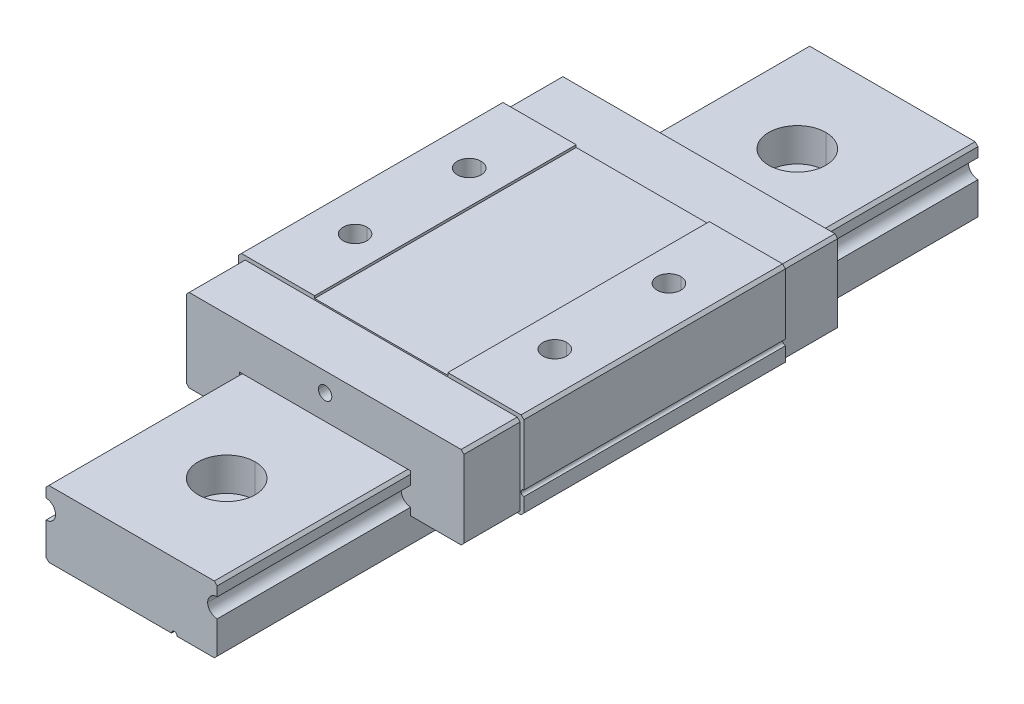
ISO-10303-21;
HEADER;
FILE_DESCRIPTION(('STEP AP214'),'2;1');
FILE_NAME('part.step','',(''),(''),'','','');
FILE_SCHEMA(('AUTOMOTIVE_DESIGN { 1 0 10303 214 1 1 1 1 }'));
ENDSEC;
DATA;
#1=APPLICATION_CONTEXT('core data for automotive mechanical design processes');
#2=APPLICATION_PROTOCOL_DEFINITION('international standard','automotive_design',2000,#1);
#3=PRODUCT_CONTEXT('',#1,'mechanical');
#4=PRODUCT('Part','Part','',(#3));
#5=PRODUCT_RELATED_PRODUCT_CATEGORY('part','',(#4));
#6=PRODUCT_DEFINITION_FORMATION('','',#4);
#7=PRODUCT_DEFINITION_CONTEXT('part definition',#1,'design');
#8=PRODUCT_DEFINITION('design','',#6,#7);
#9=PRODUCT_DEFINITION_SHAPE('','',#8);
#10=(LENGTH_UNIT() NAMED_UNIT(*) SI_UNIT(.MILLI.,.METRE.));
#11=(NAMED_UNIT(*) PLANE_ANGLE_UNIT() SI_UNIT($,.RADIAN.));
#12=(NAMED_UNIT(*) SI_UNIT($,.STERADIAN.) SOLID_ANGLE_UNIT());
#13=UNCERTAINTY_MEASURE_WITH_UNIT(LENGTH_MEASURE(1.E-05),#10,'distance_accuracy_value','');
#14=(GEOMETRIC_REPRESENTATION_CONTEXT(3) GLOBAL_UNCERTAINTY_ASSIGNED_CONTEXT((#13)) GLOBAL_UNIT_ASSIGNED_CONTEXT((#10,
#11,#12)) REPRESENTATION_CONTEXT('',''));
#15=CARTESIAN_POINT('',(0.,0.,0.));
#16=DIRECTION('',(0.,0.,1.));
#17=DIRECTION('',(1.,0.,0.));
#18=AXIS2_PLACEMENT_3D('',#15,#16,#17);
#19=CARTESIAN_POINT('',(10.5,12.,6.));
#20=DIRECTION('',(0.,1.,0.));
#21=DIRECTION('',(0.,0.,1.));
#22=AXIS2_PLACEMENT_3D('',#19,#20,#21);
#23=CYLINDRICAL_SURFACE('',#22,1.25);
#24=CARTESIAN_POINT('',(10.5,9.,6.));
#25=DIRECTION('',(0.,1.,0.));
#26=DIRECTION('',(0.,0.,1.));
#27=AXIS2_PLACEMENT_3D('',#24,#25,#26);
#28=CIRCLE('',#27,1.25);
#29=CARTESIAN_POINT('',(10.5,9.,4.75));
#30=VERTEX_POINT('',#29);
#31=CARTESIAN_POINT('',(10.5,9.,7.25));
#32=VERTEX_POINT('',#31);
#33=EDGE_CURVE('P0_E10',#30,#32,#28,.T.);
#34=ORIENTED_EDGE('',*,*,#33,.F.);
#35=DIRECTION('',(0.,1.,0.));
#36=VECTOR('',#35,1.);
#37=CARTESIAN_POINT('',(10.5,12.,4.75));
#38=LINE('',#37,#36);
#39=CARTESIAN_POINT('',(10.5,12.,4.75));
#40=VERTEX_POINT('',#39);
#41=EDGE_CURVE('P0_E2371',#30,#40,#38,.T.);
#42=ORIENTED_EDGE('',*,*,#41,.T.);
#43=CARTESIAN_POINT('',(10.5,12.,6.));
#44=DIRECTION('',(0.,1.,0.));
#45=DIRECTION('',(0.,0.,1.));
#46=AXIS2_PLACEMENT_3D('',#43,#44,#45);
#47=CIRCLE('',#46,1.25);
#48=CARTESIAN_POINT('',(10.5,12.,7.25));
#49=VERTEX_POINT('',#48);
#50=EDGE_CURVE('P0_E329',#40,#49,#47,.T.);
#51=ORIENTED_EDGE('',*,*,#50,.T.);
#52=DIRECTION('',(0.,1.,0.));
#53=VECTOR('',#52,1.);
#54=CARTESIAN_POINT('',(10.5,12.,7.25));
#55=LINE('',#54,#53);
#56=EDGE_CURVE('P0_E2373',#32,#49,#55,.T.);
#57=ORIENTED_EDGE('',*,*,#56,.F.);
#58=EDGE_LOOP('',(#34,#42,#51,#57));
#59=FACE_BOUND('',#58,.T.);
#60=ADVANCED_FACE('P0_F16',(#59),#23,.F.);
#61=CARTESIAN_POINT('',(10.5,9.,6.));
#62=DIRECTION('',(0.,1.,0.));
#63=DIRECTION('',(0.,0.,1.));
#64=AXIS2_PLACEMENT_3D('',#61,#62,#63);
#65=CONICAL_SURFACE('',#64,1.25,1.02974425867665);
#66=DIRECTION('',(0.,0.515038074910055,0.857167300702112));
#67=VECTOR('',#66,1.);
#68=CARTESIAN_POINT('',(10.5,9.,7.25));
#69=LINE('',#68,#67);
#70=CARTESIAN_POINT('',(10.5,8.24892422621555,6.));
#71=VERTEX_POINT('',#70);
#72=EDGE_CURVE('P0_E319',#71,#32,#69,.T.);
#73=ORIENTED_EDGE('',*,*,#72,.F.);
#74=DIRECTION('',(0.,0.515038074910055,-0.857167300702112));
#75=VECTOR('',#74,1.);
#76=CARTESIAN_POINT('',(10.5,9.,4.75));
#77=LINE('',#76,#75);
#78=EDGE_CURVE('P0_E337',#71,#30,#77,.T.);
#79=ORIENTED_EDGE('',*,*,#78,.T.);
#80=ORIENTED_EDGE('',*,*,#33,.T.);
#81=EDGE_LOOP('',(#73,#79,#80));
#82=FACE_BOUND('',#81,.T.);
#83=ADVANCED_FACE('P0_F1652',(#82),#65,.F.);
#84=CARTESIAN_POINT('',(-10.5,12.,6.));
#85=DIRECTION('',(0.,1.,0.));
#86=DIRECTION('',(0.,0.,1.));
#87=AXIS2_PLACEMENT_3D('',#84,#85,#86);
#88=CYLINDRICAL_SURFACE('',#87,1.25);
#89=CARTESIAN_POINT('',(-10.5,9.,6.));
#90=DIRECTION('',(0.,1.,0.));
#91=DIRECTION('',(0.,0.,1.));
#92=AXIS2_PLACEMENT_3D('',#89,#90,#91);
#93=CIRCLE('',#92,1.25);
#94=CARTESIAN_POINT('',(-10.5,9.,4.75));
#95=VERTEX_POINT('',#94);
#96=CARTESIAN_POINT('',(-10.5,9.,7.25));
#97=VERTEX_POINT('',#96);
#98=EDGE_CURVE('P0_E25',#95,#97,#93,.T.);
#99=ORIENTED_EDGE('',*,*,#98,.F.);
#100=DIRECTION('',(0.,1.,0.));
#101=VECTOR('',#100,1.);
#102=CARTESIAN_POINT('',(-10.5,12.,4.75));
#103=LINE('',#102,#101);
#104=CARTESIAN_POINT('',(-10.5,12.,4.75));
#105=VERTEX_POINT('',#104);
#106=EDGE_CURVE('P0_E313',#95,#105,#103,.T.);
#107=ORIENTED_EDGE('',*,*,#106,.T.);
#108=CARTESIAN_POINT('',(-10.5,12.,6.));
#109=DIRECTION('',(0.,1.,0.));
#110=DIRECTION('',(0.,0.,1.));
#111=AXIS2_PLACEMENT_3D('',#108,#109,#110);
#112=CIRCLE('',#111,1.25);
#113=CARTESIAN_POINT('',(-10.5,12.,7.25));
#114=VERTEX_POINT('',#113);
#115=EDGE_CURVE('P0_E305',#105,#114,#112,.T.);
#116=ORIENTED_EDGE('',*,*,#115,.T.);
#117=DIRECTION('',(0.,1.,0.));
#118=VECTOR('',#117,1.);
#119=CARTESIAN_POINT('',(-10.5,12.,7.25));
#120=LINE('',#119,#118);
#121=EDGE_CURVE('P0_E302',#97,#114,#120,.T.);
#122=ORIENTED_EDGE('',*,*,#121,.F.);
#123=EDGE_LOOP('',(#99,#107,#116,#122));
#124=FACE_BOUND('',#123,.T.);
#125=ADVANCED_FACE('P0_F303',(#124),#88,.F.);
#126=CARTESIAN_POINT('',(-10.5,9.,6.));
#127=DIRECTION('',(0.,1.,0.));
#128=DIRECTION('',(0.,0.,1.));
#129=AXIS2_PLACEMENT_3D('',#126,#127,#128);
#130=CONICAL_SURFACE('',#129,1.25,1.02974425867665);
#131=DIRECTION('',(0.,0.515038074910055,0.857167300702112));
#132=VECTOR('',#131,1.);
#133=CARTESIAN_POINT('',(-10.5,9.,7.25));
#134=LINE('',#133,#132);
#135=CARTESIAN_POINT('',(-10.5,8.24892422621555,6.));
#136=VERTEX_POINT('',#135);
#137=EDGE_CURVE('P0_E280',#136,#97,#134,.T.);
#138=ORIENTED_EDGE('',*,*,#137,.F.);
#139=DIRECTION('',(0.,0.515038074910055,-0.857167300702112));
#140=VECTOR('',#139,1.);
#141=CARTESIAN_POINT('',(-10.5,9.,4.75));
#142=LINE('',#141,#140);
#143=EDGE_CURVE('P0_E283',#136,#95,#142,.T.);
#144=ORIENTED_EDGE('',*,*,#143,.T.);
#145=ORIENTED_EDGE('',*,*,#98,.T.);
#146=EDGE_LOOP('',(#138,#144,#145));
#147=FACE_BOUND('',#146,.T.);
#148=ADVANCED_FACE('P0_F278',(#147),#130,.F.);
#149=CARTESIAN_POINT('',(-10.5,12.,-6.));
#150=DIRECTION('',(0.,1.,0.));
#151=DIRECTION('',(0.,0.,1.));
#152=AXIS2_PLACEMENT_3D('',#149,#150,#151);
#153=CYLINDRICAL_SURFACE('',#152,1.25);
#154=CARTESIAN_POINT('',(-10.5,9.,-6.));
#155=DIRECTION('',(0.,1.,0.));
#156=DIRECTION('',(0.,0.,1.));
#157=AXIS2_PLACEMENT_3D('',#154,#155,#156);
#158=CIRCLE('',#157,1.25);
#159=CARTESIAN_POINT('',(-10.5,9.,-7.25));
#160=VERTEX_POINT('',#159);
#161=CARTESIAN_POINT('',(-10.5,9.,-4.75));
#162=VERTEX_POINT('',#161);
#163=EDGE_CURVE('P0_E265',#160,#162,#158,.T.);
#164=ORIENTED_EDGE('',*,*,#163,.F.);
#165=DIRECTION('',(0.,1.,0.));
#166=VECTOR('',#165,1.);
#167=CARTESIAN_POINT('',(-10.5,12.,-7.25));
#168=LINE('',#167,#166);
#169=CARTESIAN_POINT('',(-10.5,12.,-7.25));
#170=VERTEX_POINT('',#169);
#171=EDGE_CURVE('P0_E298',#160,#170,#168,.T.);
#172=ORIENTED_EDGE('',*,*,#171,.T.);
#173=CARTESIAN_POINT('',(-10.5,12.,-6.));
#174=DIRECTION('',(0.,1.,0.));
#175=DIRECTION('',(0.,0.,1.));
#176=AXIS2_PLACEMENT_3D('',#173,#174,#175);
#177=CIRCLE('',#176,1.25);
#178=CARTESIAN_POINT('',(-10.5,12.,-4.75));
#179=VERTEX_POINT('',#178);
#180=EDGE_CURVE('P0_E458',#170,#179,#177,.T.);
#181=ORIENTED_EDGE('',*,*,#180,.T.);
#182=DIRECTION('',(0.,1.,0.));
#183=VECTOR('',#182,1.);
#184=CARTESIAN_POINT('',(-10.5,12.,-4.75));
#185=LINE('',#184,#183);
#186=EDGE_CURVE('P0_E375',#162,#179,#185,.T.);
#187=ORIENTED_EDGE('',*,*,#186,.F.);
#188=EDGE_LOOP('',(#164,#172,#181,#187));
#189=FACE_BOUND('',#188,.T.);
#190=ADVANCED_FACE('P0_F2023',(#189),#153,.F.);
#191=CARTESIAN_POINT('',(-10.5,9.,-6.));
#192=DIRECTION('',(0.,1.,0.));
#193=DIRECTION('',(0.,0.,1.));
#194=AXIS2_PLACEMENT_3D('',#191,#192,#193);
#195=CONICAL_SURFACE('',#194,1.25,1.02974425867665);
#196=DIRECTION('',(0.,0.515038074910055,0.857167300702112));
#197=VECTOR('',#196,1.);
#198=CARTESIAN_POINT('',(-10.5,9.,-4.75));
#199=LINE('',#198,#197);
#200=CARTESIAN_POINT('',(-10.5,8.24892422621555,-6.));
#201=VERTEX_POINT('',#200);
#202=EDGE_CURVE('P0_E400',#201,#162,#199,.T.);
#203=ORIENTED_EDGE('',*,*,#202,.F.);
#204=DIRECTION('',(0.,0.515038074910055,-0.857167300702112));
#205=VECTOR('',#204,1.);
#206=CARTESIAN_POINT('',(-10.5,9.,-7.25));
#207=LINE('',#206,#205);
#208=EDGE_CURVE('P0_E396',#201,#160,#207,.T.);
#209=ORIENTED_EDGE('',*,*,#208,.T.);
#210=ORIENTED_EDGE('',*,*,#163,.T.);
#211=EDGE_LOOP('',(#203,#209,#210));
#212=FACE_BOUND('',#211,.T.);
#213=ADVANCED_FACE('P0_F2012',(#212),#195,.F.);
#214=CARTESIAN_POINT('',(10.5,12.,-6.));
#215=DIRECTION('',(0.,1.,0.));
#216=DIRECTION('',(0.,0.,1.));
#217=AXIS2_PLACEMENT_3D('',#214,#215,#216);
#218=CYLINDRICAL_SURFACE('',#217,1.25);
#219=CARTESIAN_POINT('',(10.5,9.,-6.));
#220=DIRECTION('',(0.,1.,0.));
#221=DIRECTION('',(0.,0.,1.));
#222=AXIS2_PLACEMENT_3D('',#219,#220,#221);
#223=CIRCLE('',#222,1.25);
#224=CARTESIAN_POINT('',(10.5,9.,-7.25));
#225=VERTEX_POINT('',#224);
#226=CARTESIAN_POINT('',(10.5,9.,-4.75));
#227=VERTEX_POINT('',#226);
#228=EDGE_CURVE('P0_E261',#225,#227,#223,.T.);
#229=ORIENTED_EDGE('',*,*,#228,.F.);
#230=DIRECTION('',(0.,1.,0.));
#231=VECTOR('',#230,1.);
#232=CARTESIAN_POINT('',(10.5,12.,-7.25));
#233=LINE('',#232,#231);
#234=CARTESIAN_POINT('',(10.5,12.,-7.25));
#235=VERTEX_POINT('',#234);
#236=EDGE_CURVE('P0_E410',#225,#235,#233,.T.);
#237=ORIENTED_EDGE('',*,*,#236,.T.);
#238=CARTESIAN_POINT('',(10.5,12.,-6.));
#239=DIRECTION('',(0.,1.,0.));
#240=DIRECTION('',(0.,0.,1.));
#241=AXIS2_PLACEMENT_3D('',#238,#239,#240);
#242=CIRCLE('',#241,1.25);
#243=CARTESIAN_POINT('',(10.5,12.,-4.75));
#244=VERTEX_POINT('',#243);
#245=EDGE_CURVE('P0_E325',#235,#244,#242,.T.);
#246=ORIENTED_EDGE('',*,*,#245,.T.);
#247=DIRECTION('',(0.,1.,0.));
#248=VECTOR('',#247,1.);
#249=CARTESIAN_POINT('',(10.5,12.,-4.75));
#250=LINE('',#249,#248);
#251=EDGE_CURVE('P0_E429',#227,#244,#250,.T.);
#252=ORIENTED_EDGE('',*,*,#251,.F.);
#253=EDGE_LOOP('',(#229,#237,#246,#252));
#254=FACE_BOUND('',#253,.T.);
#255=ADVANCED_FACE('P0_F2001',(#254),#218,.F.);
#256=CARTESIAN_POINT('',(10.5,9.,-6.));
#257=DIRECTION('',(0.,1.,0.));
#258=DIRECTION('',(0.,0.,1.));
#259=AXIS2_PLACEMENT_3D('',#256,#257,#258);
#260=CONICAL_SURFACE('',#259,1.25,1.02974425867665);
#261=DIRECTION('',(0.,0.515038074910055,0.857167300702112));
#262=VECTOR('',#261,1.);
#263=CARTESIAN_POINT('',(10.5,9.,-4.75));
#264=LINE('',#263,#262);
#265=CARTESIAN_POINT('',(10.5,8.24892422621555,-6.));
#266=VERTEX_POINT('',#265);
#267=EDGE_CURVE('P0_E361',#266,#227,#264,.T.);
#268=ORIENTED_EDGE('',*,*,#267,.F.);
#269=DIRECTION('',(0.,0.515038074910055,-0.857167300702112));
#270=VECTOR('',#269,1.);
#271=CARTESIAN_POINT('',(10.5,9.,-7.25));
#272=LINE('',#271,#270);
#273=EDGE_CURVE('P0_E385',#266,#225,#272,.T.);
#274=ORIENTED_EDGE('',*,*,#273,.T.);
#275=ORIENTED_EDGE('',*,*,#228,.T.);
#276=EDGE_LOOP('',(#268,#274,#275));
#277=FACE_BOUND('',#276,.T.);
#278=ADVANCED_FACE('P0_F1991',(#277),#260,.F.);
#279=CARTESIAN_POINT('',(9.,4.7,40.));
#280=DIRECTION('',(0.,0.,-1.));
#281=DIRECTION('',(-1.,0.,0.));
#282=AXIS2_PLACEMENT_3D('',#279,#280,#281);
#283=CYLINDRICAL_SURFACE('',#282,1.);
#284=CARTESIAN_POINT('',(9.,4.7,19.65));
#285=DIRECTION('',(0.,0.,1.));
#286=DIRECTION('',(-1.,0.,0.));
#287=AXIS2_PLACEMENT_3D('',#284,#285,#286);
#288=CIRCLE('',#287,1.);
#289=CARTESIAN_POINT('',(8.,4.7,19.65));
#290=VERTEX_POINT('',#289);
#291=CARTESIAN_POINT('',(9.,3.7,19.65));
#292=VERTEX_POINT('',#291);
#293=EDGE_CURVE('P0_E233',#290,#292,#288,.T.);
#294=ORIENTED_EDGE('',*,*,#293,.F.);
#295=DIRECTION('',(0.,0.,-1.));
#296=VECTOR('',#295,1.);
#297=CARTESIAN_POINT('',(8.,4.7,40.));
#298=LINE('',#297,#296);
#299=CARTESIAN_POINT('',(8.,4.7,-19.65));
#300=VERTEX_POINT('',#299);
#301=EDGE_CURVE('P0_E850',#290,#300,#298,.T.);
#302=ORIENTED_EDGE('',*,*,#301,.T.);
#303=CARTESIAN_POINT('',(9.,4.7,-19.65));
#304=DIRECTION('',(0.,0.,1.));
#305=DIRECTION('',(-1.,0.,0.));
#306=AXIS2_PLACEMENT_3D('',#303,#304,#305);
#307=CIRCLE('',#306,1.);
#308=CARTESIAN_POINT('',(9.,3.7,-19.65));
#309=VERTEX_POINT('',#308);
#310=EDGE_CURVE('P0_E203',#300,#309,#307,.T.);
#311=ORIENTED_EDGE('',*,*,#310,.T.);
#312=DIRECTION('',(0.,0.,1.));
#313=VECTOR('',#312,1.);
#314=CARTESIAN_POINT('',(9.,3.7,40.));
#315=LINE('',#314,#313);
#316=EDGE_CURVE('P0_E742',#309,#292,#315,.T.);
#317=ORIENTED_EDGE('',*,*,#316,.T.);
#318=EDGE_LOOP('',(#294,#302,#311,#317));
#319=FACE_BOUND('',#318,.T.);
#320=ADVANCED_FACE('P0_F874',(#319),#283,.T.);
#321=CARTESIAN_POINT('',(0.,9.6,-19.65));
#322=DIRECTION('',(0.,0.,1.));
#323=DIRECTION('',(1.,0.,0.));
#324=AXIS2_PLACEMENT_3D('',#321,#322,#323);
#325=CYLINDRICAL_SURFACE('',#324,0.7);
#326=CARTESIAN_POINT('',(0.,9.6,-19.65));
#327=DIRECTION('',(0.,0.,-1.));
#328=DIRECTION('',(1.,0.,0.));
#329=AXIS2_PLACEMENT_3D('',#326,#327,#328);
#330=CIRCLE('',#329,0.7);
#331=CARTESIAN_POINT('',(0.7,9.6,-19.65));
#332=VERTEX_POINT('',#331);
#333=CARTESIAN_POINT('',(-0.7,9.6,-19.65));
#334=VERTEX_POINT('',#333);
#335=EDGE_CURVE('P0_E249',#332,#334,#330,.T.);
#336=ORIENTED_EDGE('',*,*,#335,.T.);
#337=DIRECTION('',(0.,0.,1.));
#338=VECTOR('',#337,1.);
#339=CARTESIAN_POINT('',(-0.7,9.6,-19.65));
#340=LINE('',#339,#338);
#341=CARTESIAN_POINT('',(-0.700000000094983,9.6,-14.65));
#342=VERTEX_POINT('',#341);
#343=EDGE_CURVE('P0_E697',#334,#342,#340,.T.);
#344=ORIENTED_EDGE('',*,*,#343,.T.);
#345=CARTESIAN_POINT('',(0.,9.6,-14.65));
#346=DIRECTION('',(0.,0.,-1.));
#347=DIRECTION('',(1.,0.,0.));
#348=AXIS2_PLACEMENT_3D('',#345,#346,#347);
#349=CIRCLE('',#348,0.7);
#350=CARTESIAN_POINT('',(0.700000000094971,9.6,-14.65));
#351=VERTEX_POINT('',#350);
#352=EDGE_CURVE('P0_E258',#351,#342,#349,.T.);
#353=ORIENTED_EDGE('',*,*,#352,.F.);
#354=DIRECTION('',(0.,0.,1.));
#355=VECTOR('',#354,1.);
#356=CARTESIAN_POINT('',(0.7,9.6,-19.65));
#357=LINE('',#356,#355);
#358=EDGE_CURVE('P0_E818',#332,#351,#357,.T.);
#359=ORIENTED_EDGE('',*,*,#358,.F.);
#360=EDGE_LOOP('',(#336,#344,#353,#359));
#361=FACE_BOUND('',#360,.T.);
#362=ADVANCED_FACE('P0_F1970',(#361),#325,.F.);
#363=CARTESIAN_POINT('',(0.,9.6,19.65));
#364=DIRECTION('',(0.,0.,-1.));
#365=DIRECTION('',(-1.,0.,0.));
#366=AXIS2_PLACEMENT_3D('',#363,#364,#365);
#367=CYLINDRICAL_SURFACE('',#366,0.7);
#368=CARTESIAN_POINT('',(0.,9.6,19.65));
#369=DIRECTION('',(0.,0.,-1.));
#370=DIRECTION('',(-1.,0.,0.));
#371=AXIS2_PLACEMENT_3D('',#368,#369,#370);
#372=CIRCLE('',#371,0.7);
#373=CARTESIAN_POINT('',(0.7,9.6,19.65));
#374=VERTEX_POINT('',#373);
#375=CARTESIAN_POINT('',(-0.7,9.6,19.65));
#376=VERTEX_POINT('',#375);
#377=EDGE_CURVE('P0_E236',#374,#376,#372,.T.);
#378=ORIENTED_EDGE('',*,*,#377,.F.);
#379=DIRECTION('',(0.,0.,-1.));
#380=VECTOR('',#379,1.);
#381=CARTESIAN_POINT('',(0.7,9.6,19.65));
#382=LINE('',#381,#380);
#383=CARTESIAN_POINT('',(0.7,9.6,14.65));
#384=VERTEX_POINT('',#383);
#385=EDGE_CURVE('P0_E794',#374,#384,#382,.T.);
#386=ORIENTED_EDGE('',*,*,#385,.T.);
#387=CARTESIAN_POINT('',(0.,9.6,14.65));
#388=DIRECTION('',(0.,0.,1.));
#389=DIRECTION('',(-1.,0.,0.));
#390=AXIS2_PLACEMENT_3D('',#387,#388,#389);
#391=CIRCLE('',#390,0.7);
#392=CARTESIAN_POINT('',(0.,8.90000000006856,14.65));
#393=VERTEX_POINT('',#392);
#394=EDGE_CURVE('P0_E664',#393,#384,#391,.T.);
#395=ORIENTED_EDGE('',*,*,#394,.F.);
#396=CARTESIAN_POINT('',(0.,9.6,14.65));
#397=DIRECTION('',(0.,0.,1.));
#398=DIRECTION('',(-1.,0.,0.));
#399=AXIS2_PLACEMENT_3D('',#396,#397,#398);
#400=CIRCLE('',#399,0.7);
#401=CARTESIAN_POINT('',(-0.7,9.6,14.65));
#402=VERTEX_POINT('',#401);
#403=EDGE_CURVE('P0_E254',#402,#393,#400,.T.);
#404=ORIENTED_EDGE('',*,*,#403,.F.);
#405=DIRECTION('',(0.,0.,-1.));
#406=VECTOR('',#405,1.);
#407=CARTESIAN_POINT('',(-0.7,9.6,19.65));
#408=LINE('',#407,#406);
#409=EDGE_CURVE('P0_E802',#376,#402,#408,.T.);
#410=ORIENTED_EDGE('',*,*,#409,.F.);
#411=EDGE_LOOP('',(#378,#386,#395,#404,#410));
#412=FACE_BOUND('',#411,.T.);
#413=ADVANCED_FACE('P0_F1959',(#412),#367,.F.);
#414=CARTESIAN_POINT('',(0.,9.6,-14.6499999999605));
#415=DIRECTION('',(0.,0.,-1.));
#416=DIRECTION('',(-1.,0.,0.));
#417=AXIS2_PLACEMENT_3D('',#414,#415,#416);
#418=CONICAL_SURFACE('',#417,0.700000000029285,1.02974425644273);
#419=DIRECTION('',(-0.857167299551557,0.,-0.5150380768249));
#420=VECTOR('',#419,1.);
#421=CARTESIAN_POINT('',(-0.700000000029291,9.6,-14.6499999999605));
#422=LINE('',#421,#420);
#423=CARTESIAN_POINT('',(0.,9.60000000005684,-14.2293975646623));
#424=VERTEX_POINT('',#423);
#425=EDGE_CURVE('P0_E394',#424,#342,#422,.T.);
#426=ORIENTED_EDGE('',*,*,#425,.F.);
#427=DIRECTION('',(0.857167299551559,0.,-0.515038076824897));
#428=VECTOR('',#427,1.);
#429=CARTESIAN_POINT('',(0.700000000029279,9.6,-14.6499999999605));
#430=LINE('',#429,#428);
#431=EDGE_CURVE('P0_E390',#424,#351,#430,.T.);
#432=ORIENTED_EDGE('',*,*,#431,.T.);
#433=ORIENTED_EDGE('',*,*,#352,.T.);
#434=EDGE_LOOP('',(#426,#432,#433));
#435=FACE_BOUND('',#434,.T.);
#436=ADVANCED_FACE('P0_F1948',(#435),#418,.F.);
#437=CARTESIAN_POINT('',(0.,9.6,14.6500000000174));
#438=DIRECTION('',(0.,0.,1.));
#439=DIRECTION('',(0.,-1.,0.));
#440=AXIS2_PLACEMENT_3D('',#437,#438,#439);
#441=CONICAL_SURFACE('',#440,0.699999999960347,1.02974425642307);
#442=DIRECTION('',(0.,-0.857167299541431,0.515038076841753));
#443=VECTOR('',#442,1.);
#444=CARTESIAN_POINT('',(0.,8.90000000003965,14.6500000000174));
#445=LINE('',#444,#443);
#446=CARTESIAN_POINT('',(0.,9.59999999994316,14.2293975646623));
#447=VERTEX_POINT('',#446);
#448=EDGE_CURVE('P0_E660',#447,#393,#445,.T.);
#449=ORIENTED_EDGE('',*,*,#448,.F.);
#450=DIRECTION('',(0.,0.857167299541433,0.515038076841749));
#451=VECTOR('',#450,1.);
#452=CARTESIAN_POINT('',(0.,10.2999999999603,14.6500000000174));
#453=LINE('',#452,#451);
#454=CARTESIAN_POINT('',(0.,10.2999999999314,14.65));
#455=VERTEX_POINT('',#454);
#456=EDGE_CURVE('P0_E651',#447,#455,#453,.T.);
#457=ORIENTED_EDGE('',*,*,#456,.T.);
#458=CARTESIAN_POINT('',(0.,9.6,14.65));
#459=DIRECTION('',(0.,0.,1.));
#460=DIRECTION('',(-1.,0.,0.));
#461=AXIS2_PLACEMENT_3D('',#458,#459,#460);
#462=CIRCLE('',#461,0.7);
#463=EDGE_CURVE('P0_E806',#455,#402,#462,.T.);
#464=ORIENTED_EDGE('',*,*,#463,.T.);
#465=ORIENTED_EDGE('',*,*,#403,.T.);
#466=EDGE_LOOP('',(#449,#457,#464,#465));
#467=FACE_BOUND('',#466,.T.);
#468=ADVANCED_FACE('P0_F1937',(#467),#441,.F.);
#469=CARTESIAN_POINT('',(15.,5.,19.65));
#470=DIRECTION('',(0.,0.,-1.));
#471=DIRECTION('',(-1.,0.,0.));
#472=AXIS2_PLACEMENT_3D('',#469,#470,#471);
#473=CYLINDRICAL_SURFACE('',#472,0.3);
#474=CARTESIAN_POINT('',(15.,5.,13.75));
#475=DIRECTION('',(0.,0.,-1.));
#476=DIRECTION('',(-1.,0.,0.));
#477=AXIS2_PLACEMENT_3D('',#474,#475,#476);
#478=CIRCLE('',#477,0.3);
#479=CARTESIAN_POINT('',(14.7,5.,13.75));
#480=VERTEX_POINT('',#479);
#481=CARTESIAN_POINT('',(15.,5.3,13.75));
#482=VERTEX_POINT('',#481);
#483=EDGE_CURVE('P0_E489',#480,#482,#478,.T.);
#484=ORIENTED_EDGE('',*,*,#483,.F.);
#485=DIRECTION('',(0.,0.,-1.));
#486=VECTOR('',#485,1.);
#487=CARTESIAN_POINT('',(14.7,5.,19.65));
#488=LINE('',#487,#486);
#489=CARTESIAN_POINT('',(14.7,5.,-13.75));
#490=VERTEX_POINT('',#489);
#491=EDGE_CURVE('P0_E453',#480,#490,#488,.T.);
#492=ORIENTED_EDGE('',*,*,#491,.T.);
#493=CARTESIAN_POINT('',(15.,5.,-13.75));
#494=DIRECTION('',(0.,0.,1.));
#495=DIRECTION('',(-1.,0.,0.));
#496=AXIS2_PLACEMENT_3D('',#493,#494,#495);
#497=CIRCLE('',#496,0.3);
#498=CARTESIAN_POINT('',(15.,5.3,-13.75));
#499=VERTEX_POINT('',#498);
#500=EDGE_CURVE('P0_E738',#499,#490,#497,.T.);
#501=ORIENTED_EDGE('',*,*,#500,.F.);
#502=DIRECTION('',(0.,0.,-1.));
#503=VECTOR('',#502,1.);
#504=CARTESIAN_POINT('',(15.,5.3,19.65));
#505=LINE('',#504,#503);
#506=EDGE_CURVE('P0_E612',#482,#499,#505,.T.);
#507=ORIENTED_EDGE('',*,*,#506,.F.);
#508=EDGE_LOOP('',(#484,#492,#501,#507));
#509=FACE_BOUND('',#508,.T.);
#510=ADVANCED_FACE('P0_F1927',(#509),#473,.F.);
#511=CARTESIAN_POINT('',(9.,7.,40.));
#512=DIRECTION('',(0.,-1.,0.));
#513=DIRECTION('',(0.,0.,-1.));
#514=AXIS2_PLACEMENT_3D('',#511,#512,#513);
#515=PLANE('',#514);
#516=DIRECTION('',(1.,0.,0.));
#517=VECTOR('',#516,1.);
#518=CARTESIAN_POINT('',(9.,7.,-19.65));
#519=LINE('',#518,#517);
#520=CARTESIAN_POINT('',(-9.,7.,-19.65));
#521=VERTEX_POINT('',#520);
#522=CARTESIAN_POINT('',(9.,7.,-19.65));
#523=VERTEX_POINT('',#522);
#524=EDGE_CURVE('P0_E246',#521,#523,#519,.T.);
#525=ORIENTED_EDGE('',*,*,#524,.T.);
#526=DIRECTION('',(0.,0.,1.));
#527=VECTOR('',#526,1.);
#528=CARTESIAN_POINT('',(9.,7.,40.));
#529=LINE('',#528,#527);
#530=CARTESIAN_POINT('',(9.,7.,19.65));
#531=VERTEX_POINT('',#530);
#532=EDGE_CURVE('P0_E38',#523,#531,#529,.T.);
#533=ORIENTED_EDGE('',*,*,#532,.T.);
#534=DIRECTION('',(-1.,0.,0.));
#535=VECTOR('',#534,1.);
#536=CARTESIAN_POINT('',(9.,7.,19.65));
#537=LINE('',#536,#535);
#538=CARTESIAN_POINT('',(-9.,7.,19.65));
#539=VERTEX_POINT('',#538);
#540=EDGE_CURVE('P0_E206',#531,#539,#537,.T.);
#541=ORIENTED_EDGE('',*,*,#540,.T.);
#542=DIRECTION('',(0.,0.,-1.));
#543=VECTOR('',#542,1.);
#544=CARTESIAN_POINT('',(-9.,7.,40.));
#545=LINE('',#544,#543);
#546=EDGE_CURVE('P0_E193',#539,#521,#545,.T.);
#547=ORIENTED_EDGE('',*,*,#546,.T.);
#548=EDGE_LOOP('',(#525,#533,#541,#547));
#549=FACE_BOUND('',#548,.T.);
#550=ADVANCED_FACE('P0_F207',(#549),#515,.T.);
#551=CARTESIAN_POINT('',(9.,5.7,40.));
#552=DIRECTION('',(-1.,0.,0.));
#553=DIRECTION('',(0.,0.,1.));
#554=AXIS2_PLACEMENT_3D('',#551,#552,#553);
#555=PLANE('',#554);
#556=DIRECTION('',(0.,-1.,0.));
#557=VECTOR('',#556,1.);
#558=CARTESIAN_POINT('',(9.,5.7,-19.65));
#559=LINE('',#558,#557);
#560=CARTESIAN_POINT('',(9.,5.7,-19.65));
#561=VERTEX_POINT('',#560);
#562=EDGE_CURVE('P0_E243',#523,#561,#559,.T.);
#563=ORIENTED_EDGE('',*,*,#562,.T.);
#564=DIRECTION('',(0.,0.,1.));
#565=VECTOR('',#564,1.);
#566=CARTESIAN_POINT('',(9.,5.7,40.));
#567=LINE('',#566,#565);
#568=CARTESIAN_POINT('',(9.,5.7,19.65));
#569=VERTEX_POINT('',#568);
#570=EDGE_CURVE('P0_E226',#561,#569,#567,.T.);
#571=ORIENTED_EDGE('',*,*,#570,.T.);
#572=DIRECTION('',(0.,1.,0.));
#573=VECTOR('',#572,1.);
#574=CARTESIAN_POINT('',(9.,5.7,19.65));
#575=LINE('',#574,#573);
#576=EDGE_CURVE('P0_E211',#569,#531,#575,.T.);
#577=ORIENTED_EDGE('',*,*,#576,.T.);
#578=ORIENTED_EDGE('',*,*,#532,.F.);
#579=EDGE_LOOP('',(#563,#571,#577,#578));
#580=FACE_BOUND('',#579,.T.);
#581=ADVANCED_FACE('P0_F866',(#580),#555,.T.);
#582=CARTESIAN_POINT('',(15.,5.,-19.65));
#583=DIRECTION('',(0.,0.,1.));
#584=DIRECTION('',(1.,0.,0.));
#585=AXIS2_PLACEMENT_3D('',#582,#583,#584);
#586=PLANE('',#585);
#587=ORIENTED_EDGE('',*,*,#335,.F.);
#588=CARTESIAN_POINT('',(0.,9.6,-19.65));
#589=DIRECTION('',(0.,0.,-1.));
#590=DIRECTION('',(1.,0.,0.));
#591=AXIS2_PLACEMENT_3D('',#588,#589,#590);
#592=CIRCLE('',#591,0.7);
#593=EDGE_CURVE('P0_E701',#334,#332,#592,.T.);
#594=ORIENTED_EDGE('',*,*,#593,.F.);
#595=EDGE_LOOP('',(#587,#594));
#596=FACE_BOUND('',#595,.T.);
#597=DIRECTION('',(0.,1.,0.));
#598=VECTOR('',#597,1.);
#599=CARTESIAN_POINT('',(14.6,5.,-19.65));
#600=LINE('',#599,#598);
#601=CARTESIAN_POINT('',(14.6,3.2,-19.65));
#602=VERTEX_POINT('',#601);
#603=CARTESIAN_POINT('',(14.6,11.3,-19.65));
#604=VERTEX_POINT('',#603);
#605=EDGE_CURVE('P0_E513',#602,#604,#600,.T.);
#606=ORIENTED_EDGE('',*,*,#605,.F.);
#607=DIRECTION('',(-0.707106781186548,-0.707106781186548,0.));
#608=VECTOR('',#607,1.);
#609=CARTESIAN_POINT('',(14.3,2.9,-19.65));
#610=LINE('',#609,#608);
#611=CARTESIAN_POINT('',(14.3,2.9,-19.65));
#612=VERTEX_POINT('',#611);
#613=EDGE_CURVE('P0_E415',#602,#612,#610,.T.);
#614=ORIENTED_EDGE('',*,*,#613,.T.);
#615=DIRECTION('',(1.,0.,0.));
#616=VECTOR('',#615,1.);
#617=CARTESIAN_POINT('',(15.,2.9,-19.65));
#618=LINE('',#617,#616);
#619=CARTESIAN_POINT('',(9.,2.9,-19.65));
#620=VERTEX_POINT('',#619);
#621=EDGE_CURVE('P0_E509',#620,#612,#618,.T.);
#622=ORIENTED_EDGE('',*,*,#621,.F.);
#623=DIRECTION('',(0.,-1.,0.));
#624=VECTOR('',#623,1.);
#625=CARTESIAN_POINT('',(9.,0.,-19.65));
#626=LINE('',#625,#624);
#627=EDGE_CURVE('P0_E588',#309,#620,#626,.T.);
#628=ORIENTED_EDGE('',*,*,#627,.F.);
#629=ORIENTED_EDGE('',*,*,#310,.F.);
#630=CARTESIAN_POINT('',(9.,4.7,-19.65));
#631=DIRECTION('',(0.,0.,1.));
#632=DIRECTION('',(-1.,0.,0.));
#633=AXIS2_PLACEMENT_3D('',#630,#631,#632);
#634=CIRCLE('',#633,1.);
#635=EDGE_CURVE('P0_E219',#561,#300,#634,.T.);
#636=ORIENTED_EDGE('',*,*,#635,.F.);
#637=ORIENTED_EDGE('',*,*,#562,.F.);
#638=ORIENTED_EDGE('',*,*,#524,.F.);
#639=DIRECTION('',(0.,1.,0.));
#640=VECTOR('',#639,1.);
#641=CARTESIAN_POINT('',(-9.,5.,-19.65));
#642=LINE('',#641,#640);
#643=CARTESIAN_POINT('',(-9.,5.7,-19.65));
#644=VERTEX_POINT('',#643);
#645=EDGE_CURVE('P0_E200',#644,#521,#642,.T.);
#646=ORIENTED_EDGE('',*,*,#645,.F.);
#647=CARTESIAN_POINT('',(-9.,4.7,-19.65));
#648=DIRECTION('',(0.,0.,1.));
#649=DIRECTION('',(-1.,0.,0.));
#650=AXIS2_PLACEMENT_3D('',#647,#648,#649);
#651=CIRCLE('',#650,1.);
#652=CARTESIAN_POINT('',(-9.,3.7,-19.65));
#653=VERTEX_POINT('',#652);
#654=EDGE_CURVE('P0_E837',#653,#644,#651,.T.);
#655=ORIENTED_EDGE('',*,*,#654,.F.);
#656=DIRECTION('',(0.,1.,0.));
#657=VECTOR('',#656,1.);
#658=CARTESIAN_POINT('',(-9.,3.7,-19.65));
#659=LINE('',#658,#657);
#660=CARTESIAN_POINT('',(-9.,2.9,-19.65));
#661=VERTEX_POINT('',#660);
#662=EDGE_CURVE('P0_E589',#661,#653,#659,.T.);
#663=ORIENTED_EDGE('',*,*,#662,.F.);
#664=DIRECTION('',(1.,0.,0.));
#665=VECTOR('',#664,1.);
#666=CARTESIAN_POINT('',(15.,2.9,-19.65));
#667=LINE('',#666,#665);
#668=CARTESIAN_POINT('',(-14.3,2.9,-19.65));
#669=VERTEX_POINT('',#668);
#670=EDGE_CURVE('P0_E833',#669,#661,#667,.T.);
#671=ORIENTED_EDGE('',*,*,#670,.F.);
#672=DIRECTION('',(-0.707106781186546,0.707106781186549,0.));
#673=VECTOR('',#672,1.);
#674=CARTESIAN_POINT('',(-14.6,3.2,-19.65));
#675=LINE('',#674,#673);
#676=CARTESIAN_POINT('',(-14.6,3.2,-19.65));
#677=VERTEX_POINT('',#676);
#678=EDGE_CURVE('P0_E435',#669,#677,#675,.T.);
#679=ORIENTED_EDGE('',*,*,#678,.T.);
#680=DIRECTION('',(0.,-1.,0.));
#681=VECTOR('',#680,1.);
#682=CARTESIAN_POINT('',(-14.6,5.,-19.65));
#683=LINE('',#682,#681);
#684=CARTESIAN_POINT('',(-14.6,11.3,-19.65));
#685=VERTEX_POINT('',#684);
#686=EDGE_CURVE('P0_E826',#685,#677,#683,.T.);
#687=ORIENTED_EDGE('',*,*,#686,.F.);
#688=DIRECTION('',(0.70710678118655,0.707106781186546,0.));
#689=VECTOR('',#688,1.);
#690=CARTESIAN_POINT('',(-14.3,11.6,-19.65));
#691=LINE('',#690,#689);
#692=CARTESIAN_POINT('',(-14.3,11.6,-19.65));
#693=VERTEX_POINT('',#692);
#694=EDGE_CURVE('P0_E479',#685,#693,#691,.T.);
#695=ORIENTED_EDGE('',*,*,#694,.T.);
#696=DIRECTION('',(-1.,0.,0.));
#697=VECTOR('',#696,1.);
#698=CARTESIAN_POINT('',(15.,11.6,-19.65));
#699=LINE('',#698,#697);
#700=CARTESIAN_POINT('',(14.3,11.6,-19.65));
#701=VERTEX_POINT('',#700);
#702=EDGE_CURVE('P0_E822',#701,#693,#699,.T.);
#703=ORIENTED_EDGE('',*,*,#702,.F.);
#704=DIRECTION('',(0.707106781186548,-0.707106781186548,0.));
#705=VECTOR('',#704,1.);
#706=CARTESIAN_POINT('',(14.6,11.3,-19.65));
#707=LINE('',#706,#705);
#708=EDGE_CURVE('P0_E566',#701,#604,#707,.T.);
#709=ORIENTED_EDGE('',*,*,#708,.T.);
#710=EDGE_LOOP('',(#606,#614,#622,#628,#629,#636,#637,#638,#646,#655,#663,#671,#679,#687,#695,
#703,#709));
#711=FACE_BOUND('',#710,.T.);
#712=ADVANCED_FACE('P0_F1121',(#596,#711),#586,.F.);
#713=CARTESIAN_POINT('',(-9.,7.,40.));
#714=DIRECTION('',(1.,0.,0.));
#715=DIRECTION('',(0.,1.,0.));
#716=AXIS2_PLACEMENT_3D('',#713,#714,#715);
#717=PLANE('',#716);
#718=ORIENTED_EDGE('',*,*,#645,.T.);
#719=ORIENTED_EDGE('',*,*,#546,.F.);
#720=DIRECTION('',(0.,-1.,0.));
#721=VECTOR('',#720,1.);
#722=CARTESIAN_POINT('',(-9.,7.,19.65));
#723=LINE('',#722,#721);
#724=CARTESIAN_POINT('',(-9.,5.7,19.65));
#725=VERTEX_POINT('',#724);
#726=EDGE_CURVE('P0_E198',#539,#725,#723,.T.);
#727=ORIENTED_EDGE('',*,*,#726,.T.);
#728=DIRECTION('',(0.,0.,-1.));
#729=VECTOR('',#728,1.);
#730=CARTESIAN_POINT('',(-9.,5.7,40.));
#731=LINE('',#730,#729);
#732=EDGE_CURVE('P0_E841',#725,#644,#731,.T.);
#733=ORIENTED_EDGE('',*,*,#732,.T.);
#734=EDGE_LOOP('',(#718,#719,#727,#733));
#735=FACE_BOUND('',#734,.T.);
#736=ADVANCED_FACE('P0_F195',(#735),#717,.T.);
#737=CARTESIAN_POINT('',(15.,5.,19.65));
#738=DIRECTION('',(0.,0.,1.));
#739=DIRECTION('',(1.,0.,0.));
#740=AXIS2_PLACEMENT_3D('',#737,#738,#739);
#741=PLANE('',#740);
#742=CARTESIAN_POINT('',(0.,9.6,19.65));
#743=DIRECTION('',(0.,0.,-1.));
#744=DIRECTION('',(-1.,0.,0.));
#745=AXIS2_PLACEMENT_3D('',#742,#743,#744);
#746=CIRCLE('',#745,0.7);
#747=EDGE_CURVE('P0_E798',#376,#374,#746,.T.);
#748=ORIENTED_EDGE('',*,*,#747,.T.);
#749=ORIENTED_EDGE('',*,*,#377,.T.);
#750=EDGE_LOOP('',(#748,#749));
#751=FACE_BOUND('',#750,.T.);
#752=CARTESIAN_POINT('',(-9.,4.7,19.65));
#753=DIRECTION('',(0.,0.,1.));
#754=DIRECTION('',(-1.,0.,0.));
#755=AXIS2_PLACEMENT_3D('',#752,#753,#754);
#756=CIRCLE('',#755,1.);
#757=CARTESIAN_POINT('',(-9.,3.7,19.65));
#758=VERTEX_POINT('',#757);
#759=EDGE_CURVE('P0_E216',#758,#725,#756,.T.);
#760=ORIENTED_EDGE('',*,*,#759,.T.);
#761=ORIENTED_EDGE('',*,*,#726,.F.);
#762=ORIENTED_EDGE('',*,*,#540,.F.);
#763=ORIENTED_EDGE('',*,*,#576,.F.);
#764=CARTESIAN_POINT('',(9.,4.7,19.65));
#765=DIRECTION('',(0.,0.,1.));
#766=DIRECTION('',(-1.,0.,0.));
#767=AXIS2_PLACEMENT_3D('',#764,#765,#766);
#768=CIRCLE('',#767,1.);
#769=EDGE_CURVE('P0_E854',#569,#290,#768,.T.);
#770=ORIENTED_EDGE('',*,*,#769,.T.);
#771=ORIENTED_EDGE('',*,*,#293,.T.);
#772=DIRECTION('',(0.,1.,0.));
#773=VECTOR('',#772,1.);
#774=CARTESIAN_POINT('',(9.,0.,19.65));
#775=LINE('',#774,#773);
#776=CARTESIAN_POINT('',(9.,2.9,19.65));
#777=VERTEX_POINT('',#776);
#778=EDGE_CURVE('P0_E587',#777,#292,#775,.T.);
#779=ORIENTED_EDGE('',*,*,#778,.F.);
#780=DIRECTION('',(1.,0.,0.));
#781=VECTOR('',#780,1.);
#782=CARTESIAN_POINT('',(15.,2.9,19.65));
#783=LINE('',#782,#781);
#784=CARTESIAN_POINT('',(14.3,2.9,19.65));
#785=VERTEX_POINT('',#784);
#786=EDGE_CURVE('P0_E514',#777,#785,#783,.T.);
#787=ORIENTED_EDGE('',*,*,#786,.T.);
#788=DIRECTION('',(-0.707106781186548,-0.707106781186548,0.));
#789=VECTOR('',#788,1.);
#790=CARTESIAN_POINT('',(14.6,3.2,19.65));
#791=LINE('',#790,#789);
#792=CARTESIAN_POINT('',(14.6,3.2,19.65));
#793=VERTEX_POINT('',#792);
#794=EDGE_CURVE('P0_E401',#793,#785,#791,.T.);
#795=ORIENTED_EDGE('',*,*,#794,.F.);
#796=DIRECTION('',(0.,1.,0.));
#797=VECTOR('',#796,1.);
#798=CARTESIAN_POINT('',(14.6,5.,19.65));
#799=LINE('',#798,#797);
#800=CARTESIAN_POINT('',(14.6,11.3,19.65));
#801=VERTEX_POINT('',#800);
#802=EDGE_CURVE('P0_E425',#793,#801,#799,.T.);
#803=ORIENTED_EDGE('',*,*,#802,.T.);
#804=DIRECTION('',(0.707106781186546,-0.70710678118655,0.));
#805=VECTOR('',#804,1.);
#806=CARTESIAN_POINT('',(14.3,11.6,19.65));
#807=LINE('',#806,#805);
#808=CARTESIAN_POINT('',(14.3,11.6,19.65));
#809=VERTEX_POINT('',#808);
#810=EDGE_CURVE('P0_E603',#809,#801,#807,.T.);
#811=ORIENTED_EDGE('',*,*,#810,.F.);
#812=DIRECTION('',(-1.,0.,0.));
#813=VECTOR('',#812,1.);
#814=CARTESIAN_POINT('',(15.,11.6,19.65));
#815=LINE('',#814,#813);
#816=CARTESIAN_POINT('',(-14.3,11.6,19.65));
#817=VERTEX_POINT('',#816);
#818=EDGE_CURVE('P0_E421',#809,#817,#815,.T.);
#819=ORIENTED_EDGE('',*,*,#818,.T.);
#820=DIRECTION('',(-0.707106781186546,-0.70710678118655,0.));
#821=VECTOR('',#820,1.);
#822=CARTESIAN_POINT('',(-14.6,11.3,19.65));
#823=LINE('',#822,#821);
#824=CARTESIAN_POINT('',(-14.6,11.3,19.65));
#825=VERTEX_POINT('',#824);
#826=EDGE_CURVE('P0_E735',#817,#825,#823,.T.);
#827=ORIENTED_EDGE('',*,*,#826,.T.);
#828=DIRECTION('',(0.,-1.,0.));
#829=VECTOR('',#828,1.);
#830=CARTESIAN_POINT('',(-14.6,5.,19.65));
#831=LINE('',#830,#829);
#832=CARTESIAN_POINT('',(-14.6,3.2,19.65));
#833=VERTEX_POINT('',#832);
#834=EDGE_CURVE('P0_E424',#825,#833,#831,.T.);
#835=ORIENTED_EDGE('',*,*,#834,.T.);
#836=DIRECTION('',(0.707106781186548,-0.707106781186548,0.));
#837=VECTOR('',#836,1.);
#838=CARTESIAN_POINT('',(-14.3,2.9,19.65));
#839=LINE('',#838,#837);
#840=CARTESIAN_POINT('',(-14.3,2.9,19.65));
#841=VERTEX_POINT('',#840);
#842=EDGE_CURVE('P0_E348',#833,#841,#839,.T.);
#843=ORIENTED_EDGE('',*,*,#842,.T.);
#844=DIRECTION('',(1.,0.,0.));
#845=VECTOR('',#844,1.);
#846=CARTESIAN_POINT('',(15.,2.9,19.65));
#847=LINE('',#846,#845);
#848=CARTESIAN_POINT('',(-9.,2.9,19.65));
#849=VERTEX_POINT('',#848);
#850=EDGE_CURVE('P0_E829',#841,#849,#847,.T.);
#851=ORIENTED_EDGE('',*,*,#850,.T.);
#852=DIRECTION('',(0.,-1.,0.));
#853=VECTOR('',#852,1.);
#854=CARTESIAN_POINT('',(-9.,3.7,19.65));
#855=LINE('',#854,#853);
#856=EDGE_CURVE('P0_E712',#758,#849,#855,.T.);
#857=ORIENTED_EDGE('',*,*,#856,.F.);
#858=EDGE_LOOP('',(#760,#761,#762,#763,#770,#771,#779,#787,#795,#803,#811,#819,#827,#835,#843,
#851,#857));
#859=FACE_BOUND('',#858,.T.);
#860=ADVANCED_FACE('P0_F213',(#751,#859),#741,.T.);
#861=CARTESIAN_POINT('',(9.,4.7,40.));
#862=DIRECTION('',(0.,0.,-1.));
#863=DIRECTION('',(-1.,0.,0.));
#864=AXIS2_PLACEMENT_3D('',#861,#862,#863);
#865=CYLINDRICAL_SURFACE('',#864,1.);
#866=ORIENTED_EDGE('',*,*,#301,.F.);
#867=ORIENTED_EDGE('',*,*,#769,.F.);
#868=ORIENTED_EDGE('',*,*,#570,.F.);
#869=ORIENTED_EDGE('',*,*,#635,.T.);
#870=EDGE_LOOP('',(#866,#867,#868,#869));
#871=FACE_BOUND('',#870,.T.);
#872=ADVANCED_FACE('P0_F872',(#871),#865,.T.);
#873=CARTESIAN_POINT('',(14.6,2.9,-19.65));
#874=DIRECTION('',(1.,0.,0.));
#875=DIRECTION('',(0.,1.,0.));
#876=AXIS2_PLACEMENT_3D('',#873,#874,#875);
#877=PLANE('',#876);
#878=ORIENTED_EDGE('',*,*,#605,.T.);
#879=DIRECTION('',(0.,0.,1.));
#880=VECTOR('',#879,1.);
#881=CARTESIAN_POINT('',(14.6,11.3,-19.65));
#882=LINE('',#881,#880);
#883=CARTESIAN_POINT('',(14.6,11.3,-13.75));
#884=VERTEX_POINT('',#883);
#885=EDGE_CURVE('P0_E565',#604,#884,#882,.T.);
#886=ORIENTED_EDGE('',*,*,#885,.T.);
#887=DIRECTION('',(0.,-1.,0.));
#888=VECTOR('',#887,1.);
#889=CARTESIAN_POINT('',(14.6,2.9,-13.75));
#890=LINE('',#889,#888);
#891=CARTESIAN_POINT('',(14.6,3.2,-13.75));
#892=VERTEX_POINT('',#891);
#893=EDGE_CURVE('P0_E355',#884,#892,#890,.T.);
#894=ORIENTED_EDGE('',*,*,#893,.T.);
#895=DIRECTION('',(0.,0.,-1.));
#896=VECTOR('',#895,1.);
#897=CARTESIAN_POINT('',(14.6,3.2,-19.65));
#898=LINE('',#897,#896);
#899=EDGE_CURVE('P0_E419',#892,#602,#898,.T.);
#900=ORIENTED_EDGE('',*,*,#899,.T.);
#901=EDGE_LOOP('',(#878,#886,#894,#900));
#902=FACE_BOUND('',#901,.T.);
#903=ADVANCED_FACE('P0_F1860',(#902),#877,.T.);
#904=CARTESIAN_POINT('',(15.,2.9,19.65));
#905=DIRECTION('',(0.,-1.,0.));
#906=DIRECTION('',(0.,0.,-1.));
#907=AXIS2_PLACEMENT_3D('',#904,#905,#906);
#908=PLANE('',#907);
#909=DIRECTION('',(1.,0.,0.));
#910=VECTOR('',#909,1.);
#911=CARTESIAN_POINT('',(-15.,2.9,13.75));
#912=LINE('',#911,#910);
#913=CARTESIAN_POINT('',(14.3,2.9,13.75));
#914=VERTEX_POINT('',#913);
#915=CARTESIAN_POINT('',(14.7,2.9,13.75));
#916=VERTEX_POINT('',#915);
#917=EDGE_CURVE('P0_E490',#914,#916,#912,.T.);
#918=ORIENTED_EDGE('',*,*,#917,.F.);
#919=DIRECTION('',(0.,0.,1.));
#920=VECTOR('',#919,1.);
#921=CARTESIAN_POINT('',(14.3,2.9,19.65));
#922=LINE('',#921,#920);
#923=EDGE_CURVE('P0_E405',#914,#785,#922,.T.);
#924=ORIENTED_EDGE('',*,*,#923,.T.);
#925=ORIENTED_EDGE('',*,*,#786,.F.);
#926=DIRECTION('',(0.,0.,-1.));
#927=VECTOR('',#926,1.);
#928=CARTESIAN_POINT('',(9.,2.9,19.65));
#929=LINE('',#928,#927);
#930=EDGE_CURVE('P0_E583',#777,#620,#929,.T.);
#931=ORIENTED_EDGE('',*,*,#930,.T.);
#932=ORIENTED_EDGE('',*,*,#621,.T.);
#933=DIRECTION('',(0.,0.,1.));
#934=VECTOR('',#933,1.);
#935=CARTESIAN_POINT('',(14.3,2.9,19.65));
#936=LINE('',#935,#934);
#937=CARTESIAN_POINT('',(14.3,2.9,-13.75));
#938=VERTEX_POINT('',#937);
#939=EDGE_CURVE('P0_E688',#612,#938,#936,.T.);
#940=ORIENTED_EDGE('',*,*,#939,.T.);
#941=DIRECTION('',(1.,0.,0.));
#942=VECTOR('',#941,1.);
#943=CARTESIAN_POINT('',(15.,2.9,-13.75));
#944=LINE('',#943,#942);
#945=CARTESIAN_POINT('',(14.7,2.9,-13.75));
#946=VERTEX_POINT('',#945);
#947=EDGE_CURVE('P0_E356',#938,#946,#944,.T.);
#948=ORIENTED_EDGE('',*,*,#947,.T.);
#949=DIRECTION('',(0.,0.,1.));
#950=VECTOR('',#949,1.);
#951=CARTESIAN_POINT('',(14.7,2.9,19.65));
#952=LINE('',#951,#950);
#953=EDGE_CURVE('P0_E678',#946,#916,#952,.T.);
#954=ORIENTED_EDGE('',*,*,#953,.T.);
#955=EDGE_LOOP('',(#918,#924,#925,#931,#932,#940,#948,#954));
#956=FACE_BOUND('',#955,.T.);
#957=ADVANCED_FACE('P0_F884',(#956),#908,.T.);
#958=CARTESIAN_POINT('',(-9.,4.7,40.));
#959=DIRECTION('',(0.,0.,-1.));
#960=DIRECTION('',(-1.,0.,0.));
#961=AXIS2_PLACEMENT_3D('',#958,#959,#960);
#962=CYLINDRICAL_SURFACE('',#961,1.);
#963=ORIENTED_EDGE('',*,*,#654,.T.);
#964=ORIENTED_EDGE('',*,*,#732,.F.);
#965=ORIENTED_EDGE('',*,*,#759,.F.);
#966=DIRECTION('',(0.,0.,-1.));
#967=VECTOR('',#966,1.);
#968=CARTESIAN_POINT('',(-9.,3.7,40.));
#969=LINE('',#968,#967);
#970=EDGE_CURVE('P0_E593',#758,#653,#969,.T.);
#971=ORIENTED_EDGE('',*,*,#970,.T.);
#972=EDGE_LOOP('',(#963,#964,#965,#971));
#973=FACE_BOUND('',#972,.T.);
#974=ADVANCED_FACE('P0_F1119',(#973),#962,.T.);
#975=CARTESIAN_POINT('',(15.,2.9,19.65));
#976=DIRECTION('',(0.,-1.,0.));
#977=DIRECTION('',(0.,0.,-1.));
#978=AXIS2_PLACEMENT_3D('',#975,#976,#977);
#979=PLANE('',#978);
#980=ORIENTED_EDGE('',*,*,#850,.F.);
#981=DIRECTION('',(0.,0.,-1.));
#982=VECTOR('',#981,1.);
#983=CARTESIAN_POINT('',(-14.3,2.9,19.65));
#984=LINE('',#983,#982);
#985=CARTESIAN_POINT('',(-14.3,2.9,13.75));
#986=VERTEX_POINT('',#985);
#987=EDGE_CURVE('P0_E347',#841,#986,#984,.T.);
#988=ORIENTED_EDGE('',*,*,#987,.T.);
#989=DIRECTION('',(1.,0.,0.));
#990=VECTOR('',#989,1.);
#991=CARTESIAN_POINT('',(-15.,2.9,13.75));
#992=LINE('',#991,#990);
#993=CARTESIAN_POINT('',(-14.7,2.9,13.75));
#994=VERTEX_POINT('',#993);
#995=EDGE_CURVE('P0_E705',#994,#986,#992,.T.);
#996=ORIENTED_EDGE('',*,*,#995,.F.);
#997=DIRECTION('',(0.,0.,-1.));
#998=VECTOR('',#997,1.);
#999=CARTESIAN_POINT('',(-14.7,2.9,19.65));
#1000=LINE('',#999,#998);
#1001=CARTESIAN_POINT('',(-14.7,2.9,-13.75));
#1002=VERTEX_POINT('',#1001);
#1003=EDGE_CURVE('P0_E380',#994,#1002,#1000,.T.);
#1004=ORIENTED_EDGE('',*,*,#1003,.T.);
#1005=DIRECTION('',(1.,0.,0.));
#1006=VECTOR('',#1005,1.);
#1007=CARTESIAN_POINT('',(15.,2.9,-13.75));
#1008=LINE('',#1007,#1006);
#1009=CARTESIAN_POINT('',(-14.3,2.9,-13.75));
#1010=VERTEX_POINT('',#1009);
#1011=EDGE_CURVE('P0_E420',#1002,#1010,#1008,.T.);
#1012=ORIENTED_EDGE('',*,*,#1011,.T.);
#1013=DIRECTION('',(0.,0.,-1.));
#1014=VECTOR('',#1013,1.);
#1015=CARTESIAN_POINT('',(-14.3,2.9,19.65));
#1016=LINE('',#1015,#1014);
#1017=EDGE_CURVE('P0_E430',#1010,#669,#1016,.T.);
#1018=ORIENTED_EDGE('',*,*,#1017,.T.);
#1019=ORIENTED_EDGE('',*,*,#670,.T.);
#1020=DIRECTION('',(0.,0.,1.));
#1021=VECTOR('',#1020,1.);
#1022=CARTESIAN_POINT('',(-9.,2.9,19.65));
#1023=LINE('',#1022,#1021);
#1024=EDGE_CURVE('P0_E635',#661,#849,#1023,.T.);
#1025=ORIENTED_EDGE('',*,*,#1024,.T.);
#1026=EDGE_LOOP('',(#980,#988,#996,#1004,#1012,#1018,#1019,#1025));
#1027=FACE_BOUND('',#1026,.T.);
#1028=ADVANCED_FACE('P0_F1112',(#1027),#979,.T.);
#1029=CARTESIAN_POINT('',(-14.6,11.6,-19.65));
#1030=DIRECTION('',(-1.,0.,0.));
#1031=DIRECTION('',(0.,0.,1.));
#1032=AXIS2_PLACEMENT_3D('',#1029,#1030,#1031);
#1033=PLANE('',#1032);
#1034=ORIENTED_EDGE('',*,*,#686,.T.);
#1035=DIRECTION('',(0.,0.,1.));
#1036=VECTOR('',#1035,1.);
#1037=CARTESIAN_POINT('',(-14.6,3.2,-19.65));
#1038=LINE('',#1037,#1036);
#1039=CARTESIAN_POINT('',(-14.6,3.2,-13.75));
#1040=VERTEX_POINT('',#1039);
#1041=EDGE_CURVE('P0_E498',#677,#1040,#1038,.T.);
#1042=ORIENTED_EDGE('',*,*,#1041,.T.);
#1043=DIRECTION('',(0.,1.,0.));
#1044=VECTOR('',#1043,1.);
#1045=CARTESIAN_POINT('',(-14.6,11.6,-13.75));
#1046=LINE('',#1045,#1044);
#1047=CARTESIAN_POINT('',(-14.6,11.3,-13.75));
#1048=VERTEX_POINT('',#1047);
#1049=EDGE_CURVE('P0_E552',#1040,#1048,#1046,.T.);
#1050=ORIENTED_EDGE('',*,*,#1049,.T.);
#1051=DIRECTION('',(0.,0.,-1.));
#1052=VECTOR('',#1051,1.);
#1053=CARTESIAN_POINT('',(-14.6,11.3,-19.65));
#1054=LINE('',#1053,#1052);
#1055=EDGE_CURVE('P0_E652',#1048,#685,#1054,.T.);
#1056=ORIENTED_EDGE('',*,*,#1055,.T.);
#1057=EDGE_LOOP('',(#1034,#1042,#1050,#1056));
#1058=FACE_BOUND('',#1057,.T.);
#1059=ADVANCED_FACE('P0_F1830',(#1058),#1033,.T.);
#1060=CARTESIAN_POINT('',(15.,11.6,-19.65));
#1061=DIRECTION('',(0.,1.,0.));
#1062=DIRECTION('',(1.,0.,0.));
#1063=AXIS2_PLACEMENT_3D('',#1060,#1061,#1062);
#1064=PLANE('',#1063);
#1065=ORIENTED_EDGE('',*,*,#702,.T.);
#1066=DIRECTION('',(0.,0.,1.));
#1067=VECTOR('',#1066,1.);
#1068=CARTESIAN_POINT('',(-14.3,11.6,-19.65));
#1069=LINE('',#1068,#1067);
#1070=CARTESIAN_POINT('',(-14.3,11.6,-13.75));
#1071=VERTEX_POINT('',#1070);
#1072=EDGE_CURVE('P0_E381',#693,#1071,#1069,.T.);
#1073=ORIENTED_EDGE('',*,*,#1072,.T.);
#1074=DIRECTION('',(1.,0.,0.));
#1075=VECTOR('',#1074,1.);
#1076=CARTESIAN_POINT('',(15.,11.6,-13.75));
#1077=LINE('',#1076,#1075);
#1078=CARTESIAN_POINT('',(14.3,11.6,-13.75));
#1079=VERTEX_POINT('',#1078);
#1080=EDGE_CURVE('P0_E556',#1071,#1079,#1077,.T.);
#1081=ORIENTED_EDGE('',*,*,#1080,.T.);
#1082=DIRECTION('',(0.,0.,-1.));
#1083=VECTOR('',#1082,1.);
#1084=CARTESIAN_POINT('',(14.3,11.6,-19.65));
#1085=LINE('',#1084,#1083);
#1086=EDGE_CURVE('P0_E561',#1079,#701,#1085,.T.);
#1087=ORIENTED_EDGE('',*,*,#1086,.T.);
#1088=EDGE_LOOP('',(#1065,#1073,#1081,#1087));
#1089=FACE_BOUND('',#1088,.T.);
#1090=ADVANCED_FACE('P0_F1819',(#1089),#1064,.T.);
#1091=CARTESIAN_POINT('',(0.,9.6,-19.65));
#1092=DIRECTION('',(0.,0.,1.));
#1093=DIRECTION('',(1.,0.,0.));
#1094=AXIS2_PLACEMENT_3D('',#1091,#1092,#1093);
#1095=CYLINDRICAL_SURFACE('',#1094,0.7);
#1096=ORIENTED_EDGE('',*,*,#343,.F.);
#1097=ORIENTED_EDGE('',*,*,#593,.T.);
#1098=ORIENTED_EDGE('',*,*,#358,.T.);
#1099=CARTESIAN_POINT('',(0.,9.6,-14.65));
#1100=DIRECTION('',(0.,0.,-1.));
#1101=DIRECTION('',(1.,0.,0.));
#1102=AXIS2_PLACEMENT_3D('',#1099,#1100,#1101);
#1103=CIRCLE('',#1102,0.7);
#1104=EDGE_CURVE('P0_E475',#342,#351,#1103,.T.);
#1105=ORIENTED_EDGE('',*,*,#1104,.F.);
#1106=EDGE_LOOP('',(#1096,#1097,#1098,#1105));
#1107=FACE_BOUND('',#1106,.T.);
#1108=ADVANCED_FACE('P0_F1809',(#1107),#1095,.F.);
#1109=CARTESIAN_POINT('',(-14.6,2.9,19.65));
#1110=DIRECTION('',(-1.,0.,0.));
#1111=DIRECTION('',(0.,0.,1.));
#1112=AXIS2_PLACEMENT_3D('',#1109,#1110,#1111);
#1113=PLANE('',#1112);
#1114=ORIENTED_EDGE('',*,*,#834,.F.);
#1115=DIRECTION('',(0.,0.,-1.));
#1116=VECTOR('',#1115,1.);
#1117=CARTESIAN_POINT('',(-14.6,11.3,19.65));
#1118=LINE('',#1117,#1116);
#1119=CARTESIAN_POINT('',(-14.6,11.3,13.75));
#1120=VERTEX_POINT('',#1119);
#1121=EDGE_CURVE('P0_E395',#825,#1120,#1118,.T.);
#1122=ORIENTED_EDGE('',*,*,#1121,.T.);
#1123=DIRECTION('',(0.,-1.,0.));
#1124=VECTOR('',#1123,1.);
#1125=CARTESIAN_POINT('',(-14.6,2.9,13.75));
#1126=LINE('',#1125,#1124);
#1127=CARTESIAN_POINT('',(-14.6,3.2,13.75));
#1128=VERTEX_POINT('',#1127);
#1129=EDGE_CURVE('P0_E665',#1120,#1128,#1126,.T.);
#1130=ORIENTED_EDGE('',*,*,#1129,.T.);
#1131=DIRECTION('',(0.,0.,1.));
#1132=VECTOR('',#1131,1.);
#1133=CARTESIAN_POINT('',(-14.6,3.2,19.65));
#1134=LINE('',#1133,#1132);
#1135=EDGE_CURVE('P0_E344',#1128,#833,#1134,.T.);
#1136=ORIENTED_EDGE('',*,*,#1135,.T.);
#1137=EDGE_LOOP('',(#1114,#1122,#1130,#1136));
#1138=FACE_BOUND('',#1137,.T.);
#1139=ADVANCED_FACE('P0_F1105',(#1138),#1113,.T.);
#1140=CARTESIAN_POINT('',(-15.,11.6,19.65));
#1141=DIRECTION('',(0.,1.,0.));
#1142=DIRECTION('',(1.,0.,0.));
#1143=AXIS2_PLACEMENT_3D('',#1140,#1141,#1142);
#1144=PLANE('',#1143);
#1145=ORIENTED_EDGE('',*,*,#818,.F.);
#1146=DIRECTION('',(0.,0.,-1.));
#1147=VECTOR('',#1146,1.);
#1148=CARTESIAN_POINT('',(14.3,11.6,19.65));
#1149=LINE('',#1148,#1147);
#1150=CARTESIAN_POINT('',(14.3,11.6,13.75));
#1151=VERTEX_POINT('',#1150);
#1152=EDGE_CURVE('P0_E692',#809,#1151,#1149,.T.);
#1153=ORIENTED_EDGE('',*,*,#1152,.T.);
#1154=DIRECTION('',(-1.,0.,0.));
#1155=VECTOR('',#1154,1.);
#1156=CARTESIAN_POINT('',(-15.,11.6,13.75));
#1157=LINE('',#1156,#1155);
#1158=CARTESIAN_POINT('',(-14.3,11.6,13.75));
#1159=VERTEX_POINT('',#1158);
#1160=EDGE_CURVE('P0_E696',#1151,#1159,#1157,.T.);
#1161=ORIENTED_EDGE('',*,*,#1160,.T.);
#1162=DIRECTION('',(0.,0.,1.));
#1163=VECTOR('',#1162,1.);
#1164=CARTESIAN_POINT('',(-14.3,11.6,19.65));
#1165=LINE('',#1164,#1163);
#1166=EDGE_CURVE('P0_E578',#1159,#817,#1165,.T.);
#1167=ORIENTED_EDGE('',*,*,#1166,.T.);
#1168=EDGE_LOOP('',(#1145,#1153,#1161,#1167));
#1169=FACE_BOUND('',#1168,.T.);
#1170=ADVANCED_FACE('P0_F911',(#1169),#1144,.T.);
#1171=CARTESIAN_POINT('',(14.6,2.9,19.65));
#1172=DIRECTION('',(-1.,0.,0.));
#1173=DIRECTION('',(0.,0.,1.));
#1174=AXIS2_PLACEMENT_3D('',#1171,#1172,#1173);
#1175=PLANE('',#1174);
#1176=DIRECTION('',(0.,-1.,0.));
#1177=VECTOR('',#1176,1.);
#1178=CARTESIAN_POINT('',(14.6,2.9,13.75));
#1179=LINE('',#1178,#1177);
#1180=CARTESIAN_POINT('',(14.6,11.3,13.75));
#1181=VERTEX_POINT('',#1180);
#1182=CARTESIAN_POINT('',(14.6,3.2,13.75));
#1183=VERTEX_POINT('',#1182);
#1184=EDGE_CURVE('P0_E628',#1181,#1183,#1179,.T.);
#1185=ORIENTED_EDGE('',*,*,#1184,.F.);
#1186=DIRECTION('',(0.,0.,-1.));
#1187=VECTOR('',#1186,1.);
#1188=CARTESIAN_POINT('',(14.6,11.3,19.65));
#1189=LINE('',#1188,#1187);
#1190=EDGE_CURVE('P0_E598',#801,#1181,#1189,.T.);
#1191=ORIENTED_EDGE('',*,*,#1190,.F.);
#1192=ORIENTED_EDGE('',*,*,#802,.F.);
#1193=DIRECTION('',(0.,0.,1.));
#1194=VECTOR('',#1193,1.);
#1195=CARTESIAN_POINT('',(14.6,3.2,19.65));
#1196=LINE('',#1195,#1194);
#1197=EDGE_CURVE('P0_E543',#1183,#793,#1196,.T.);
#1198=ORIENTED_EDGE('',*,*,#1197,.F.);
#1199=EDGE_LOOP('',(#1185,#1191,#1192,#1198));
#1200=FACE_BOUND('',#1199,.T.);
#1201=ADVANCED_FACE('P0_F900',(#1200),#1175,.F.);
#1202=CARTESIAN_POINT('',(0.,9.6,19.65));
#1203=DIRECTION('',(0.,0.,-1.));
#1204=DIRECTION('',(-1.,0.,0.));
#1205=AXIS2_PLACEMENT_3D('',#1202,#1203,#1204);
#1206=CYLINDRICAL_SURFACE('',#1205,0.7);
#1207=ORIENTED_EDGE('',*,*,#385,.F.);
#1208=ORIENTED_EDGE('',*,*,#747,.F.);
#1209=ORIENTED_EDGE('',*,*,#409,.T.);
#1210=ORIENTED_EDGE('',*,*,#463,.F.);
#1211=CARTESIAN_POINT('',(0.,9.6,14.65));
#1212=DIRECTION('',(0.,0.,1.));
#1213=DIRECTION('',(-1.,0.,0.));
#1214=AXIS2_PLACEMENT_3D('',#1211,#1212,#1213);
#1215=CIRCLE('',#1214,0.7);
#1216=EDGE_CURVE('P0_E674',#384,#455,#1215,.T.);
#1217=ORIENTED_EDGE('',*,*,#1216,.F.);
#1218=EDGE_LOOP('',(#1207,#1208,#1209,#1210,#1217));
#1219=FACE_BOUND('',#1218,.T.);
#1220=ADVANCED_FACE('P0_F1564',(#1219),#1206,.F.);
#1221=CARTESIAN_POINT('',(14.6,11.3,-19.65));
#1222=DIRECTION('',(-0.707106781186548,-0.707106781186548,0.));
#1223=DIRECTION('',(-0.707106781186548,0.707106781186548,0.));
#1224=AXIS2_PLACEMENT_3D('',#1221,#1222,#1223);
#1225=PLANE('',#1224);
#1226=ORIENTED_EDGE('',*,*,#708,.F.);
#1227=ORIENTED_EDGE('',*,*,#1086,.F.);
#1228=DIRECTION('',(-0.707106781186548,0.707106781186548,0.));
#1229=VECTOR('',#1228,1.);
#1230=CARTESIAN_POINT('',(14.6,11.3,-13.75));
#1231=LINE('',#1230,#1229);
#1232=EDGE_CURVE('P0_E474',#884,#1079,#1231,.T.);
#1233=ORIENTED_EDGE('',*,*,#1232,.F.);
#1234=ORIENTED_EDGE('',*,*,#885,.F.);
#1235=EDGE_LOOP('',(#1226,#1227,#1233,#1234));
#1236=FACE_BOUND('',#1235,.T.);
#1237=ADVANCED_FACE('P0_F1567',(#1236),#1225,.F.);
#1238=CARTESIAN_POINT('',(14.3,2.9,19.65));
#1239=DIRECTION('',(-0.707106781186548,0.707106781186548,0.));
#1240=DIRECTION('',(0.,0.,1.));
#1241=AXIS2_PLACEMENT_3D('',#1238,#1239,#1240);
#1242=PLANE('',#1241);
#1243=ORIENTED_EDGE('',*,*,#613,.F.);
#1244=ORIENTED_EDGE('',*,*,#899,.F.);
#1245=DIRECTION('',(0.707106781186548,0.707106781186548,0.));
#1246=VECTOR('',#1245,1.);
#1247=CARTESIAN_POINT('',(14.3,2.9,-13.75));
#1248=LINE('',#1247,#1246);
#1249=EDGE_CURVE('P0_E352',#938,#892,#1248,.T.);
#1250=ORIENTED_EDGE('',*,*,#1249,.F.);
#1251=ORIENTED_EDGE('',*,*,#939,.F.);
#1252=EDGE_LOOP('',(#1243,#1244,#1250,#1251));
#1253=FACE_BOUND('',#1252,.T.);
#1254=ADVANCED_FACE('P0_F1125',(#1253),#1242,.F.);
#1255=CARTESIAN_POINT('',(15.,12.,-13.75));
#1256=DIRECTION('',(0.,0.,-1.));
#1257=DIRECTION('',(0.,-1.,0.));
#1258=AXIS2_PLACEMENT_3D('',#1255,#1256,#1257);
#1259=PLANE('',#1258);
#1260=DIRECTION('',(1.,0.,0.));
#1261=VECTOR('',#1260,1.);
#1262=CARTESIAN_POINT('',(15.,12.,-13.75));
#1263=LINE('',#1262,#1261);
#1264=CARTESIAN_POINT('',(-14.7,12.,-13.75));
#1265=VERTEX_POINT('',#1264);
#1266=CARTESIAN_POINT('',(-7.,12.,-13.75));
#1267=VERTEX_POINT('',#1266);
#1268=EDGE_CURVE('P0_E570',#1265,#1267,#1263,.T.);
#1269=ORIENTED_EDGE('',*,*,#1268,.T.);
#1270=DIRECTION('',(0.,-1.,0.));
#1271=VECTOR('',#1270,1.);
#1272=CARTESIAN_POINT('',(-7.,12.,-13.75));
#1273=LINE('',#1272,#1271);
#1274=CARTESIAN_POINT('',(-7.,11.75,-13.75));
#1275=VERTEX_POINT('',#1274);
#1276=EDGE_CURVE('P0_E522',#1267,#1275,#1273,.T.);
#1277=ORIENTED_EDGE('',*,*,#1276,.T.);
#1278=DIRECTION('',(1.,0.,0.));
#1279=VECTOR('',#1278,1.);
#1280=CARTESIAN_POINT('',(15.,11.75,-13.75));
#1281=LINE('',#1280,#1279);
#1282=CARTESIAN_POINT('',(7.,11.75,-13.75));
#1283=VERTEX_POINT('',#1282);
#1284=EDGE_CURVE('P0_E582',#1275,#1283,#1281,.T.);
#1285=ORIENTED_EDGE('',*,*,#1284,.T.);
#1286=DIRECTION('',(0.,-1.,0.));
#1287=VECTOR('',#1286,1.);
#1288=CARTESIAN_POINT('',(7.,12.,-13.75));
#1289=LINE('',#1288,#1287);
#1290=CARTESIAN_POINT('',(7.,12.,-13.75));
#1291=VERTEX_POINT('',#1290);
#1292=EDGE_CURVE('P0_E449',#1291,#1283,#1289,.T.);
#1293=ORIENTED_EDGE('',*,*,#1292,.F.);
#1294=DIRECTION('',(1.,0.,0.));
#1295=VECTOR('',#1294,1.);
#1296=CARTESIAN_POINT('',(15.,12.,-13.75));
#1297=LINE('',#1296,#1295);
#1298=CARTESIAN_POINT('',(14.7,12.,-13.75));
#1299=VERTEX_POINT('',#1298);
#1300=EDGE_CURVE('P0_E330',#1291,#1299,#1297,.T.);
#1301=ORIENTED_EDGE('',*,*,#1300,.T.);
#1302=DIRECTION('',(0.70710678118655,-0.707106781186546,0.));
#1303=VECTOR('',#1302,1.);
#1304=CARTESIAN_POINT('',(14.7,12.,-13.75));
#1305=LINE('',#1304,#1303);
#1306=CARTESIAN_POINT('',(15.,11.7,-13.75));
#1307=VERTEX_POINT('',#1306);
#1308=EDGE_CURVE('P0_E494',#1299,#1307,#1305,.T.);
#1309=ORIENTED_EDGE('',*,*,#1308,.T.);
#1310=DIRECTION('',(0.,-1.,0.));
#1311=VECTOR('',#1310,1.);
#1312=CARTESIAN_POINT('',(15.,12.,-13.75));
#1313=LINE('',#1312,#1311);
#1314=EDGE_CURVE('P0_E616',#1307,#499,#1313,.T.);
#1315=ORIENTED_EDGE('',*,*,#1314,.T.);
#1316=ORIENTED_EDGE('',*,*,#500,.T.);
#1317=CARTESIAN_POINT('',(15.,5.,-13.75));
#1318=DIRECTION('',(0.,0.,1.));
#1319=DIRECTION('',(-1.,0.,0.));
#1320=AXIS2_PLACEMENT_3D('',#1317,#1318,#1319);
#1321=CIRCLE('',#1320,0.3);
#1322=CARTESIAN_POINT('',(15.,4.7,-13.75));
#1323=VERTEX_POINT('',#1322);
#1324=EDGE_CURVE('P0_E470',#490,#1323,#1321,.T.);
#1325=ORIENTED_EDGE('',*,*,#1324,.T.);
#1326=DIRECTION('',(0.,1.,0.));
#1327=VECTOR('',#1326,1.);
#1328=CARTESIAN_POINT('',(15.,4.7,-13.75));
#1329=LINE('',#1328,#1327);
#1330=CARTESIAN_POINT('',(15.,3.2,-13.75));
#1331=VERTEX_POINT('',#1330);
#1332=EDGE_CURVE('P0_E574',#1331,#1323,#1329,.T.);
#1333=ORIENTED_EDGE('',*,*,#1332,.F.);
#1334=DIRECTION('',(-0.707106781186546,-0.70710678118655,0.));
#1335=VECTOR('',#1334,1.);
#1336=CARTESIAN_POINT('',(15.,3.2,-13.75));
#1337=LINE('',#1336,#1335);
#1338=EDGE_CURVE('P0_E406',#1331,#946,#1337,.T.);
#1339=ORIENTED_EDGE('',*,*,#1338,.T.);
#1340=ORIENTED_EDGE('',*,*,#947,.F.);
#1341=ORIENTED_EDGE('',*,*,#1249,.T.);
#1342=ORIENTED_EDGE('',*,*,#893,.F.);
#1343=ORIENTED_EDGE('',*,*,#1232,.T.);
#1344=ORIENTED_EDGE('',*,*,#1080,.F.);
#1345=DIRECTION('',(-0.707106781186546,-0.70710678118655,0.));
#1346=VECTOR('',#1345,1.);
#1347=CARTESIAN_POINT('',(-14.3,11.6,-13.75));
#1348=LINE('',#1347,#1346);
#1349=EDGE_CURVE('P0_E656',#1071,#1048,#1348,.T.);
#1350=ORIENTED_EDGE('',*,*,#1349,.T.);
#1351=ORIENTED_EDGE('',*,*,#1049,.F.);
#1352=DIRECTION('',(0.707106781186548,-0.707106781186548,0.));
#1353=VECTOR('',#1352,1.);
#1354=CARTESIAN_POINT('',(-14.6,3.2,-13.75));
#1355=LINE('',#1354,#1353);
#1356=EDGE_CURVE('P0_E434',#1040,#1010,#1355,.T.);
#1357=ORIENTED_EDGE('',*,*,#1356,.T.);
#1358=ORIENTED_EDGE('',*,*,#1011,.F.);
#1359=DIRECTION('',(-0.707106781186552,0.707106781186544,0.));
#1360=VECTOR('',#1359,1.);
#1361=CARTESIAN_POINT('',(-14.7,2.9,-13.75));
#1362=LINE('',#1361,#1360);
#1363=CARTESIAN_POINT('',(-15.,3.2,-13.75));
#1364=VERTEX_POINT('',#1363);
#1365=EDGE_CURVE('P0_E376',#1002,#1364,#1362,.T.);
#1366=ORIENTED_EDGE('',*,*,#1365,.T.);
#1367=DIRECTION('',(0.,1.,0.));
#1368=VECTOR('',#1367,1.);
#1369=CARTESIAN_POINT('',(-15.,12.,-13.75));
#1370=LINE('',#1369,#1368);
#1371=CARTESIAN_POINT('',(-15.,11.7,-13.75));
#1372=VERTEX_POINT('',#1371);
#1373=EDGE_CURVE('P0_E607',#1364,#1372,#1370,.T.);
#1374=ORIENTED_EDGE('',*,*,#1373,.T.);
#1375=DIRECTION('',(0.707106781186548,0.707106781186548,0.));
#1376=VECTOR('',#1375,1.);
#1377=CARTESIAN_POINT('',(-15.,11.7,-13.75));
#1378=LINE('',#1377,#1376);
#1379=EDGE_CURVE('P0_E539',#1372,#1265,#1378,.T.);
#1380=ORIENTED_EDGE('',*,*,#1379,.T.);
#1381=EDGE_LOOP('',(#1269,#1277,#1285,#1293,#1301,#1309,#1315,#1316,#1325,#1333,#1339,#1340,
#1341,#1342,#1343,#1344,#1350,#1351,#1357,#1358,#1366,#1374,#1380));
#1382=FACE_BOUND('',#1381,.T.);
#1383=ADVANCED_FACE('P0_F1133',(#1382),#1259,.T.);
#1384=CARTESIAN_POINT('',(14.6,3.2,19.65));
#1385=DIRECTION('',(0.707106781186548,-0.707106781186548,0.));
#1386=DIRECTION('',(0.,0.,-1.));
#1387=AXIS2_PLACEMENT_3D('',#1384,#1385,#1386);
#1388=PLANE('',#1387);
#1389=ORIENTED_EDGE('',*,*,#794,.T.);
#1390=ORIENTED_EDGE('',*,*,#923,.F.);
#1391=DIRECTION('',(0.707106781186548,0.707106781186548,0.));
#1392=VECTOR('',#1391,1.);
#1393=CARTESIAN_POINT('',(14.6,3.2,13.75));
#1394=LINE('',#1393,#1392);
#1395=EDGE_CURVE('P0_E624',#914,#1183,#1394,.T.);
#1396=ORIENTED_EDGE('',*,*,#1395,.T.);
#1397=ORIENTED_EDGE('',*,*,#1197,.T.);
#1398=EDGE_LOOP('',(#1389,#1390,#1396,#1397));
#1399=FACE_BOUND('',#1398,.T.);
#1400=ADVANCED_FACE('P0_F889',(#1399),#1388,.T.);
#1401=CARTESIAN_POINT('',(15.,3.2,19.65));
#1402=DIRECTION('',(-0.707106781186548,0.707106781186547,0.));
#1403=DIRECTION('',(0.,0.,1.));
#1404=AXIS2_PLACEMENT_3D('',#1401,#1402,#1403);
#1405=PLANE('',#1404);
#1406=DIRECTION('',(0.707106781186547,0.707106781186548,0.));
#1407=VECTOR('',#1406,1.);
#1408=CARTESIAN_POINT('',(15.,3.2,13.75));
#1409=LINE('',#1408,#1407);
#1410=CARTESIAN_POINT('',(15.,3.2,13.75));
#1411=VERTEX_POINT('',#1410);
#1412=EDGE_CURVE('P0_E485',#916,#1411,#1409,.T.);
#1413=ORIENTED_EDGE('',*,*,#1412,.F.);
#1414=ORIENTED_EDGE('',*,*,#953,.F.);
#1415=ORIENTED_EDGE('',*,*,#1338,.F.);
#1416=DIRECTION('',(0.,0.,-1.));
#1417=VECTOR('',#1416,1.);
#1418=CARTESIAN_POINT('',(15.,3.2,19.65));
#1419=LINE('',#1418,#1417);
#1420=EDGE_CURVE('P0_E560',#1411,#1331,#1419,.T.);
#1421=ORIENTED_EDGE('',*,*,#1420,.F.);
#1422=EDGE_LOOP('',(#1413,#1414,#1415,#1421));
#1423=FACE_BOUND('',#1422,.T.);
#1424=ADVANCED_FACE('P0_F1137',(#1423),#1405,.F.);
#1425=CARTESIAN_POINT('',(9.,0.,40.));
#1426=DIRECTION('',(-1.,0.,0.));
#1427=DIRECTION('',(0.,0.,1.));
#1428=AXIS2_PLACEMENT_3D('',#1425,#1426,#1427);
#1429=PLANE('',#1428);
#1430=ORIENTED_EDGE('',*,*,#627,.T.);
#1431=ORIENTED_EDGE('',*,*,#930,.F.);
#1432=ORIENTED_EDGE('',*,*,#778,.T.);
#1433=ORIENTED_EDGE('',*,*,#316,.F.);
#1434=EDGE_LOOP('',(#1430,#1431,#1432,#1433));
#1435=FACE_BOUND('',#1434,.T.);
#1436=ADVANCED_FACE('P0_F880',(#1435),#1429,.T.);
#1437=CARTESIAN_POINT('',(-9.,3.7,40.));
#1438=DIRECTION('',(1.,0.,0.));
#1439=DIRECTION('',(0.,1.,0.));
#1440=AXIS2_PLACEMENT_3D('',#1437,#1438,#1439);
#1441=PLANE('',#1440);
#1442=ORIENTED_EDGE('',*,*,#662,.T.);
#1443=ORIENTED_EDGE('',*,*,#970,.F.);
#1444=ORIENTED_EDGE('',*,*,#856,.T.);
#1445=ORIENTED_EDGE('',*,*,#1024,.F.);
#1446=EDGE_LOOP('',(#1442,#1443,#1444,#1445));
#1447=FACE_BOUND('',#1446,.T.);
#1448=ADVANCED_FACE('P0_F1116',(#1447),#1441,.T.);
#1449=CARTESIAN_POINT('',(-14.3,2.9,19.65));
#1450=DIRECTION('',(0.707106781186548,0.707106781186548,0.));
#1451=DIRECTION('',(0.,0.,-1.));
#1452=AXIS2_PLACEMENT_3D('',#1449,#1450,#1451);
#1453=PLANE('',#1452);
#1454=ORIENTED_EDGE('',*,*,#842,.F.);
#1455=ORIENTED_EDGE('',*,*,#1135,.F.);
#1456=DIRECTION('',(-0.707106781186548,0.707106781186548,0.));
#1457=VECTOR('',#1456,1.);
#1458=CARTESIAN_POINT('',(-14.3,2.9,13.75));
#1459=LINE('',#1458,#1457);
#1460=EDGE_CURVE('P0_E670',#986,#1128,#1459,.T.);
#1461=ORIENTED_EDGE('',*,*,#1460,.F.);
#1462=ORIENTED_EDGE('',*,*,#987,.F.);
#1463=EDGE_LOOP('',(#1454,#1455,#1461,#1462));
#1464=FACE_BOUND('',#1463,.T.);
#1465=ADVANCED_FACE('P0_F1109',(#1464),#1453,.F.);
#1466=CARTESIAN_POINT('',(-14.6,3.2,-19.65));
#1467=DIRECTION('',(0.707106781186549,0.707106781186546,0.));
#1468=DIRECTION('',(0.,0.,-1.));
#1469=AXIS2_PLACEMENT_3D('',#1466,#1467,#1468);
#1470=PLANE('',#1469);
#1471=ORIENTED_EDGE('',*,*,#678,.F.);
#1472=ORIENTED_EDGE('',*,*,#1017,.F.);
#1473=ORIENTED_EDGE('',*,*,#1356,.F.);
#1474=ORIENTED_EDGE('',*,*,#1041,.F.);
#1475=EDGE_LOOP('',(#1471,#1472,#1473,#1474));
#1476=FACE_BOUND('',#1475,.T.);
#1477=ADVANCED_FACE('P0_F1724',(#1476),#1470,.F.);
#1478=CARTESIAN_POINT('',(-14.7,2.9,19.65));
#1479=DIRECTION('',(0.707106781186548,0.707106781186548,0.));
#1480=DIRECTION('',(0.,0.,-1.));
#1481=AXIS2_PLACEMENT_3D('',#1478,#1479,#1480);
#1482=PLANE('',#1481);
#1483=DIRECTION('',(0.707106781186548,-0.707106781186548,0.));
#1484=VECTOR('',#1483,1.);
#1485=CARTESIAN_POINT('',(-14.7,2.9,13.75));
#1486=LINE('',#1485,#1484);
#1487=CARTESIAN_POINT('',(-15.,3.2,13.75));
#1488=VERTEX_POINT('',#1487);
#1489=EDGE_CURVE('P0_E731',#1488,#994,#1486,.T.);
#1490=ORIENTED_EDGE('',*,*,#1489,.F.);
#1491=DIRECTION('',(0.,0.,1.));
#1492=VECTOR('',#1491,1.);
#1493=CARTESIAN_POINT('',(-15.,3.2,19.65));
#1494=LINE('',#1493,#1492);
#1495=EDGE_CURVE('P0_E611',#1364,#1488,#1494,.T.);
#1496=ORIENTED_EDGE('',*,*,#1495,.F.);
#1497=ORIENTED_EDGE('',*,*,#1365,.F.);
#1498=ORIENTED_EDGE('',*,*,#1003,.F.);
#1499=EDGE_LOOP('',(#1490,#1496,#1497,#1498));
#1500=FACE_BOUND('',#1499,.T.);
#1501=ADVANCED_FACE('P0_F1713',(#1500),#1482,.F.);
#1502=CARTESIAN_POINT('',(-14.3,11.6,-19.65));
#1503=DIRECTION('',(0.707106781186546,-0.70710678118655,0.));
#1504=DIRECTION('',(0.,0.,-1.));
#1505=AXIS2_PLACEMENT_3D('',#1502,#1503,#1504);
#1506=PLANE('',#1505);
#1507=ORIENTED_EDGE('',*,*,#694,.F.);
#1508=ORIENTED_EDGE('',*,*,#1055,.F.);
#1509=ORIENTED_EDGE('',*,*,#1349,.F.);
#1510=ORIENTED_EDGE('',*,*,#1072,.F.);
#1511=EDGE_LOOP('',(#1507,#1508,#1509,#1510));
#1512=FACE_BOUND('',#1511,.T.);
#1513=ADVANCED_FACE('P0_F1702',(#1512),#1506,.F.);
#1514=CARTESIAN_POINT('',(0.,9.6,-14.6499999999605));
#1515=DIRECTION('',(0.,0.,-1.));
#1516=DIRECTION('',(-1.,0.,0.));
#1517=AXIS2_PLACEMENT_3D('',#1514,#1515,#1516);
#1518=CONICAL_SURFACE('',#1517,0.700000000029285,1.02974425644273);
#1519=ORIENTED_EDGE('',*,*,#431,.F.);
#1520=ORIENTED_EDGE('',*,*,#425,.T.);
#1521=ORIENTED_EDGE('',*,*,#1104,.T.);
#1522=EDGE_LOOP('',(#1519,#1520,#1521));
#1523=FACE_BOUND('',#1522,.T.);
#1524=ADVANCED_FACE('P0_F1692',(#1523),#1518,.F.);
#1525=CARTESIAN_POINT('',(-14.6,11.3,19.65));
#1526=DIRECTION('',(0.70710678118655,-0.707106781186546,0.));
#1527=DIRECTION('',(0.,0.,-1.));
#1528=AXIS2_PLACEMENT_3D('',#1525,#1526,#1527);
#1529=PLANE('',#1528);
#1530=ORIENTED_EDGE('',*,*,#826,.F.);
#1531=ORIENTED_EDGE('',*,*,#1166,.F.);
#1532=DIRECTION('',(0.707106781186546,0.70710678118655,0.));
#1533=VECTOR('',#1532,1.);
#1534=CARTESIAN_POINT('',(-14.6,11.3,13.75));
#1535=LINE('',#1534,#1533);
#1536=EDGE_CURVE('P0_E669',#1120,#1159,#1535,.T.);
#1537=ORIENTED_EDGE('',*,*,#1536,.F.);
#1538=ORIENTED_EDGE('',*,*,#1121,.F.);
#1539=EDGE_LOOP('',(#1530,#1531,#1537,#1538));
#1540=FACE_BOUND('',#1539,.T.);
#1541=ADVANCED_FACE('P0_F1100',(#1540),#1529,.F.);
#1542=CARTESIAN_POINT('',(-15.,12.,13.75));
#1543=DIRECTION('',(0.,0.,1.));
#1544=DIRECTION('',(1.,0.,0.));
#1545=AXIS2_PLACEMENT_3D('',#1542,#1543,#1544);
#1546=PLANE('',#1545);
#1547=ORIENTED_EDGE('',*,*,#995,.T.);
#1548=ORIENTED_EDGE('',*,*,#1460,.T.);
#1549=ORIENTED_EDGE('',*,*,#1129,.F.);
#1550=ORIENTED_EDGE('',*,*,#1536,.T.);
#1551=ORIENTED_EDGE('',*,*,#1160,.F.);
#1552=DIRECTION('',(0.707106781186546,-0.70710678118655,0.));
#1553=VECTOR('',#1552,1.);
#1554=CARTESIAN_POINT('',(14.3,11.6,13.75));
#1555=LINE('',#1554,#1553);
#1556=EDGE_CURVE('P0_E602',#1151,#1181,#1555,.T.);
#1557=ORIENTED_EDGE('',*,*,#1556,.T.);
#1558=ORIENTED_EDGE('',*,*,#1184,.T.);
#1559=ORIENTED_EDGE('',*,*,#1395,.F.);
#1560=ORIENTED_EDGE('',*,*,#917,.T.);
#1561=ORIENTED_EDGE('',*,*,#1412,.T.);
#1562=DIRECTION('',(0.,1.,0.));
#1563=VECTOR('',#1562,1.);
#1564=CARTESIAN_POINT('',(15.,12.,13.75));
#1565=LINE('',#1564,#1563);
#1566=CARTESIAN_POINT('',(15.,4.7,13.75));
#1567=VERTEX_POINT('',#1566);
#1568=EDGE_CURVE('P0_E551',#1411,#1567,#1565,.T.);
#1569=ORIENTED_EDGE('',*,*,#1568,.T.);
#1570=CARTESIAN_POINT('',(15.,5.,13.75));
#1571=DIRECTION('',(0.,0.,-1.));
#1572=DIRECTION('',(-1.,0.,0.));
#1573=AXIS2_PLACEMENT_3D('',#1570,#1571,#1572);
#1574=CIRCLE('',#1573,0.3);
#1575=EDGE_CURVE('P0_E457',#1567,#480,#1574,.T.);
#1576=ORIENTED_EDGE('',*,*,#1575,.T.);
#1577=ORIENTED_EDGE('',*,*,#483,.T.);
#1578=DIRECTION('',(0.,1.,0.));
#1579=VECTOR('',#1578,1.);
#1580=CARTESIAN_POINT('',(15.,12.,13.75));
#1581=LINE('',#1580,#1579);
#1582=CARTESIAN_POINT('',(15.,11.7,13.75));
#1583=VERTEX_POINT('',#1582);
#1584=EDGE_CURVE('P0_E620',#482,#1583,#1581,.T.);
#1585=ORIENTED_EDGE('',*,*,#1584,.T.);
#1586=DIRECTION('',(-0.70710678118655,0.707106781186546,0.));
#1587=VECTOR('',#1586,1.);
#1588=CARTESIAN_POINT('',(14.7,12.,13.75));
#1589=LINE('',#1588,#1587);
#1590=CARTESIAN_POINT('',(14.7,12.,13.75));
#1591=VERTEX_POINT('',#1590);
#1592=EDGE_CURVE('P0_E480',#1583,#1591,#1589,.T.);
#1593=ORIENTED_EDGE('',*,*,#1592,.T.);
#1594=DIRECTION('',(-1.,0.,0.));
#1595=VECTOR('',#1594,1.);
#1596=CARTESIAN_POINT('',(-15.,12.,13.75));
#1597=LINE('',#1596,#1595);
#1598=CARTESIAN_POINT('',(7.,12.,13.75));
#1599=VERTEX_POINT('',#1598);
#1600=EDGE_CURVE('P0_E367',#1591,#1599,#1597,.T.);
#1601=ORIENTED_EDGE('',*,*,#1600,.T.);
#1602=DIRECTION('',(0.,1.,0.));
#1603=VECTOR('',#1602,1.);
#1604=CARTESIAN_POINT('',(7.,12.,13.75));
#1605=LINE('',#1604,#1603);
#1606=CARTESIAN_POINT('',(7.,11.75,13.75));
#1607=VERTEX_POINT('',#1606);
#1608=EDGE_CURVE('P0_E331',#1607,#1599,#1605,.T.);
#1609=ORIENTED_EDGE('',*,*,#1608,.F.);
#1610=DIRECTION('',(-1.,0.,0.));
#1611=VECTOR('',#1610,1.);
#1612=CARTESIAN_POINT('',(-15.,11.75,13.75));
#1613=LINE('',#1612,#1611);
#1614=CARTESIAN_POINT('',(-7.,11.75,13.75));
#1615=VERTEX_POINT('',#1614);
#1616=EDGE_CURVE('P0_E597',#1607,#1615,#1613,.T.);
#1617=ORIENTED_EDGE('',*,*,#1616,.T.);
#1618=DIRECTION('',(0.,1.,0.));
#1619=VECTOR('',#1618,1.);
#1620=CARTESIAN_POINT('',(-7.,12.,13.75));
#1621=LINE('',#1620,#1619);
#1622=CARTESIAN_POINT('',(-7.,12.,13.75));
#1623=VERTEX_POINT('',#1622);
#1624=EDGE_CURVE('P0_E504',#1615,#1623,#1621,.T.);
#1625=ORIENTED_EDGE('',*,*,#1624,.T.);
#1626=DIRECTION('',(-1.,0.,0.));
#1627=VECTOR('',#1626,1.);
#1628=CARTESIAN_POINT('',(-15.,12.,13.75));
#1629=LINE('',#1628,#1627);
#1630=CARTESIAN_POINT('',(-14.7,12.,13.75));
#1631=VERTEX_POINT('',#1630);
#1632=EDGE_CURVE('P0_E462',#1623,#1631,#1629,.T.);
#1633=ORIENTED_EDGE('',*,*,#1632,.T.);
#1634=DIRECTION('',(-0.707106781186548,-0.707106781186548,0.));
#1635=VECTOR('',#1634,1.);
#1636=CARTESIAN_POINT('',(-15.,11.7,13.75));
#1637=LINE('',#1636,#1635);
#1638=CARTESIAN_POINT('',(-15.,11.7,13.75));
#1639=VERTEX_POINT('',#1638);
#1640=EDGE_CURVE('P0_E499',#1631,#1639,#1637,.T.);
#1641=ORIENTED_EDGE('',*,*,#1640,.T.);
#1642=DIRECTION('',(0.,-1.,0.));
#1643=VECTOR('',#1642,1.);
#1644=CARTESIAN_POINT('',(-15.,12.,13.75));
#1645=LINE('',#1644,#1643);
#1646=EDGE_CURVE('P0_E639',#1639,#1488,#1645,.T.);
#1647=ORIENTED_EDGE('',*,*,#1646,.T.);
#1648=ORIENTED_EDGE('',*,*,#1489,.T.);
#1649=EDGE_LOOP('',(#1547,#1548,#1549,#1550,#1551,#1557,#1558,#1559,#1560,#1561,#1569,#1576,
#1577,#1585,#1593,#1601,#1609,#1617,#1625,#1633,#1641,#1647,#1648));
#1650=FACE_BOUND('',#1649,.T.);
#1651=ADVANCED_FACE('P0_F1139',(#1650),#1546,.T.);
#1652=CARTESIAN_POINT('',(14.3,11.6,19.65));
#1653=DIRECTION('',(0.70710678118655,0.707106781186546,0.));
#1654=DIRECTION('',(0.,0.,-1.));
#1655=AXIS2_PLACEMENT_3D('',#1652,#1653,#1654);
#1656=PLANE('',#1655);
#1657=ORIENTED_EDGE('',*,*,#810,.T.);
#1658=ORIENTED_EDGE('',*,*,#1190,.T.);
#1659=ORIENTED_EDGE('',*,*,#1556,.F.);
#1660=ORIENTED_EDGE('',*,*,#1152,.F.);
#1661=EDGE_LOOP('',(#1657,#1658,#1659,#1660));
#1662=FACE_BOUND('',#1661,.T.);
#1663=ADVANCED_FACE('P0_F904',(#1662),#1656,.T.);
#1664=CARTESIAN_POINT('',(0.,9.6,14.6500000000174));
#1665=DIRECTION('',(0.,0.,1.));
#1666=DIRECTION('',(0.,-1.,0.));
#1667=AXIS2_PLACEMENT_3D('',#1664,#1665,#1666);
#1668=CONICAL_SURFACE('',#1667,0.699999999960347,1.02974425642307);
#1669=ORIENTED_EDGE('',*,*,#456,.F.);
#1670=ORIENTED_EDGE('',*,*,#448,.T.);
#1671=ORIENTED_EDGE('',*,*,#394,.T.);
#1672=ORIENTED_EDGE('',*,*,#1216,.T.);
#1673=EDGE_LOOP('',(#1669,#1670,#1671,#1672));
#1674=FACE_BOUND('',#1673,.T.);
#1675=ADVANCED_FACE('P0_F1362',(#1674),#1668,.F.);
#1676=CARTESIAN_POINT('',(-15.,12.,19.65));
#1677=DIRECTION('',(0.,1.,0.));
#1678=DIRECTION('',(1.,0.,0.));
#1679=AXIS2_PLACEMENT_3D('',#1676,#1677,#1678);
#1680=PLANE('',#1679);
#1681=CARTESIAN_POINT('',(-10.5,12.,6.));
#1682=DIRECTION('',(0.,1.,0.));
#1683=DIRECTION('',(0.,0.,1.));
#1684=AXIS2_PLACEMENT_3D('',#1681,#1682,#1683);
#1685=CIRCLE('',#1684,1.25);
#1686=EDGE_CURVE('P0_E310',#114,#105,#1685,.T.);
#1687=ORIENTED_EDGE('',*,*,#1686,.F.);
#1688=ORIENTED_EDGE('',*,*,#115,.F.);
#1689=EDGE_LOOP('',(#1687,#1688));
#1690=FACE_BOUND('',#1689,.T.);
#1691=CARTESIAN_POINT('',(-10.5,12.,-6.));
#1692=DIRECTION('',(0.,1.,0.));
#1693=DIRECTION('',(0.,0.,1.));
#1694=AXIS2_PLACEMENT_3D('',#1691,#1692,#1693);
#1695=CIRCLE('',#1694,1.25);
#1696=EDGE_CURVE('P0_E389',#179,#170,#1695,.T.);
#1697=ORIENTED_EDGE('',*,*,#1696,.F.);
#1698=ORIENTED_EDGE('',*,*,#180,.F.);
#1699=EDGE_LOOP('',(#1697,#1698));
#1700=FACE_BOUND('',#1699,.T.);
#1701=ORIENTED_EDGE('',*,*,#1268,.F.);
#1702=DIRECTION('',(0.,0.,1.));
#1703=VECTOR('',#1702,1.);
#1704=CARTESIAN_POINT('',(-14.7,12.,19.65));
#1705=LINE('',#1704,#1703);
#1706=EDGE_CURVE('P0_E503',#1265,#1631,#1705,.T.);
#1707=ORIENTED_EDGE('',*,*,#1706,.T.);
#1708=ORIENTED_EDGE('',*,*,#1632,.F.);
#1709=DIRECTION('',(0.,0.,-1.));
#1710=VECTOR('',#1709,1.);
#1711=CARTESIAN_POINT('',(-7.,12.,19.65));
#1712=LINE('',#1711,#1710);
#1713=EDGE_CURVE('P0_E529',#1623,#1267,#1712,.T.);
#1714=ORIENTED_EDGE('',*,*,#1713,.T.);
#1715=EDGE_LOOP('',(#1701,#1707,#1708,#1714));
#1716=FACE_BOUND('',#1715,.T.);
#1717=ADVANCED_FACE('P0_F1357',(#1690,#1700,#1716),#1680,.T.);
#1718=CARTESIAN_POINT('',(-15.,2.9,19.65));
#1719=DIRECTION('',(-1.,0.,0.));
#1720=DIRECTION('',(0.,0.,1.));
#1721=AXIS2_PLACEMENT_3D('',#1718,#1719,#1720);
#1722=PLANE('',#1721);
#1723=ORIENTED_EDGE('',*,*,#1373,.F.);
#1724=ORIENTED_EDGE('',*,*,#1495,.T.);
#1725=ORIENTED_EDGE('',*,*,#1646,.F.);
#1726=DIRECTION('',(0.,0.,-1.));
#1727=VECTOR('',#1726,1.);
#1728=CARTESIAN_POINT('',(-15.,11.7,19.65));
#1729=LINE('',#1728,#1727);
#1730=EDGE_CURVE('P0_E547',#1639,#1372,#1729,.T.);
#1731=ORIENTED_EDGE('',*,*,#1730,.T.);
#1732=EDGE_LOOP('',(#1723,#1724,#1725,#1731));
#1733=FACE_BOUND('',#1732,.T.);
#1734=ADVANCED_FACE('P0_F1327',(#1733),#1722,.T.);
#1735=CARTESIAN_POINT('',(15.,12.,19.65));
#1736=DIRECTION('',(1.,0.,0.));
#1737=DIRECTION('',(0.,1.,0.));
#1738=AXIS2_PLACEMENT_3D('',#1735,#1736,#1737);
#1739=PLANE('',#1738);
#1740=ORIENTED_EDGE('',*,*,#1314,.F.);
#1741=DIRECTION('',(0.,0.,1.));
#1742=VECTOR('',#1741,1.);
#1743=CARTESIAN_POINT('',(15.,11.7,19.65));
#1744=LINE('',#1743,#1742);
#1745=EDGE_CURVE('P0_E484',#1307,#1583,#1744,.T.);
#1746=ORIENTED_EDGE('',*,*,#1745,.T.);
#1747=ORIENTED_EDGE('',*,*,#1584,.F.);
#1748=ORIENTED_EDGE('',*,*,#506,.T.);
#1749=EDGE_LOOP('',(#1740,#1746,#1747,#1748));
#1750=FACE_BOUND('',#1749,.T.);
#1751=ADVANCED_FACE('P0_F1321',(#1750),#1739,.T.);
#1752=CARTESIAN_POINT('',(-15.,12.,19.65));
#1753=DIRECTION('',(0.,1.,0.));
#1754=DIRECTION('',(1.,0.,0.));
#1755=AXIS2_PLACEMENT_3D('',#1752,#1753,#1754);
#1756=PLANE('',#1755);
#1757=CARTESIAN_POINT('',(10.5,12.,6.));
#1758=DIRECTION('',(0.,1.,0.));
#1759=DIRECTION('',(0.,0.,1.));
#1760=AXIS2_PLACEMENT_3D('',#1757,#1758,#1759);
#1761=CIRCLE('',#1760,1.25);
#1762=EDGE_CURVE('P0_E322',#49,#40,#1761,.T.);
#1763=ORIENTED_EDGE('',*,*,#1762,.F.);
#1764=ORIENTED_EDGE('',*,*,#50,.F.);
#1765=EDGE_LOOP('',(#1763,#1764));
#1766=FACE_BOUND('',#1765,.T.);
#1767=CARTESIAN_POINT('',(10.5,12.,-6.));
#1768=DIRECTION('',(0.,1.,0.));
#1769=DIRECTION('',(0.,0.,1.));
#1770=AXIS2_PLACEMENT_3D('',#1767,#1768,#1769);
#1771=CIRCLE('',#1770,1.25);
#1772=EDGE_CURVE('P0_E439',#244,#235,#1771,.T.);
#1773=ORIENTED_EDGE('',*,*,#1772,.F.);
#1774=ORIENTED_EDGE('',*,*,#245,.F.);
#1775=EDGE_LOOP('',(#1773,#1774));
#1776=FACE_BOUND('',#1775,.T.);
#1777=ORIENTED_EDGE('',*,*,#1600,.F.);
#1778=DIRECTION('',(0.,0.,-1.));
#1779=VECTOR('',#1778,1.);
#1780=CARTESIAN_POINT('',(14.7,12.,19.65));
#1781=LINE('',#1780,#1779);
#1782=EDGE_CURVE('P0_E508',#1591,#1299,#1781,.T.);
#1783=ORIENTED_EDGE('',*,*,#1782,.T.);
#1784=ORIENTED_EDGE('',*,*,#1300,.F.);
#1785=DIRECTION('',(0.,0.,1.));
#1786=VECTOR('',#1785,1.);
#1787=CARTESIAN_POINT('',(7.,12.,19.65));
#1788=LINE('',#1787,#1786);
#1789=EDGE_CURVE('P0_E335',#1291,#1599,#1788,.T.);
#1790=ORIENTED_EDGE('',*,*,#1789,.T.);
#1791=EDGE_LOOP('',(#1777,#1783,#1784,#1790));
#1792=FACE_BOUND('',#1791,.T.);
#1793=ADVANCED_FACE('P0_F1326',(#1766,#1776,#1792),#1756,.T.);
#1794=CARTESIAN_POINT('',(-15.,11.75,13.75));
#1795=DIRECTION('',(0.,1.,0.));
#1796=DIRECTION('',(1.,0.,0.));
#1797=AXIS2_PLACEMENT_3D('',#1794,#1795,#1796);
#1798=PLANE('',#1797);
#1799=ORIENTED_EDGE('',*,*,#1284,.F.);
#1800=DIRECTION('',(0.,0.,1.));
#1801=VECTOR('',#1800,1.);
#1802=CARTESIAN_POINT('',(-7.,11.75,13.75));
#1803=LINE('',#1802,#1801);
#1804=EDGE_CURVE('P0_E518',#1275,#1615,#1803,.T.);
#1805=ORIENTED_EDGE('',*,*,#1804,.T.);
#1806=ORIENTED_EDGE('',*,*,#1616,.F.);
#1807=DIRECTION('',(0.,0.,-1.));
#1808=VECTOR('',#1807,1.);
#1809=CARTESIAN_POINT('',(7.,11.75,13.75));
#1810=LINE('',#1809,#1808);
#1811=EDGE_CURVE('P0_E336',#1607,#1283,#1810,.T.);
#1812=ORIENTED_EDGE('',*,*,#1811,.T.);
#1813=EDGE_LOOP('',(#1799,#1805,#1806,#1812));
#1814=FACE_BOUND('',#1813,.T.);
#1815=ADVANCED_FACE('P0_F1309',(#1814),#1798,.T.);
#1816=CARTESIAN_POINT('',(15.,4.7,19.65));
#1817=DIRECTION('',(1.,0.,0.));
#1818=DIRECTION('',(0.,1.,0.));
#1819=AXIS2_PLACEMENT_3D('',#1816,#1817,#1818);
#1820=PLANE('',#1819);
#1821=ORIENTED_EDGE('',*,*,#1568,.F.);
#1822=ORIENTED_EDGE('',*,*,#1420,.T.);
#1823=ORIENTED_EDGE('',*,*,#1332,.T.);
#1824=DIRECTION('',(0.,0.,1.));
#1825=VECTOR('',#1824,1.);
#1826=CARTESIAN_POINT('',(15.,4.7,19.65));
#1827=LINE('',#1826,#1825);
#1828=EDGE_CURVE('P0_E466',#1323,#1567,#1827,.T.);
#1829=ORIENTED_EDGE('',*,*,#1828,.T.);
#1830=EDGE_LOOP('',(#1821,#1822,#1823,#1829));
#1831=FACE_BOUND('',#1830,.T.);
#1832=ADVANCED_FACE('P0_F1303',(#1831),#1820,.T.);
#1833=CARTESIAN_POINT('',(-15.,11.7,19.65));
#1834=DIRECTION('',(0.707106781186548,-0.707106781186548,0.));
#1835=DIRECTION('',(0.,0.,-1.));
#1836=AXIS2_PLACEMENT_3D('',#1833,#1834,#1835);
#1837=PLANE('',#1836);
#1838=ORIENTED_EDGE('',*,*,#1640,.F.);
#1839=ORIENTED_EDGE('',*,*,#1706,.F.);
#1840=ORIENTED_EDGE('',*,*,#1379,.F.);
#1841=ORIENTED_EDGE('',*,*,#1730,.F.);
#1842=EDGE_LOOP('',(#1838,#1839,#1840,#1841));
#1843=FACE_BOUND('',#1842,.T.);
#1844=ADVANCED_FACE('P0_F1308',(#1843),#1837,.F.);
#1845=CARTESIAN_POINT('',(-7.,12.,13.75));
#1846=DIRECTION('',(-1.,0.,0.));
#1847=DIRECTION('',(0.,0.,1.));
#1848=AXIS2_PLACEMENT_3D('',#1845,#1846,#1847);
#1849=PLANE('',#1848);
#1850=ORIENTED_EDGE('',*,*,#1804,.F.);
#1851=ORIENTED_EDGE('',*,*,#1276,.F.);
#1852=ORIENTED_EDGE('',*,*,#1713,.F.);
#1853=ORIENTED_EDGE('',*,*,#1624,.F.);
#1854=EDGE_LOOP('',(#1850,#1851,#1852,#1853));
#1855=FACE_BOUND('',#1854,.T.);
#1856=ADVANCED_FACE('P0_F1342',(#1855),#1849,.F.);
#1857=CARTESIAN_POINT('',(14.7,12.,19.65));
#1858=DIRECTION('',(-0.707106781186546,-0.70710678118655,0.));
#1859=DIRECTION('',(-0.70710678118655,0.707106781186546,0.));
#1860=AXIS2_PLACEMENT_3D('',#1857,#1858,#1859);
#1861=PLANE('',#1860);
#1862=ORIENTED_EDGE('',*,*,#1592,.F.);
#1863=ORIENTED_EDGE('',*,*,#1745,.F.);
#1864=ORIENTED_EDGE('',*,*,#1308,.F.);
#1865=ORIENTED_EDGE('',*,*,#1782,.F.);
#1866=EDGE_LOOP('',(#1862,#1863,#1864,#1865));
#1867=FACE_BOUND('',#1866,.T.);
#1868=ADVANCED_FACE('P0_F1336',(#1867),#1861,.F.);
#1869=CARTESIAN_POINT('',(15.,5.,19.65));
#1870=DIRECTION('',(0.,0.,-1.));
#1871=DIRECTION('',(-1.,0.,0.));
#1872=AXIS2_PLACEMENT_3D('',#1869,#1870,#1871);
#1873=CYLINDRICAL_SURFACE('',#1872,0.3);
#1874=ORIENTED_EDGE('',*,*,#491,.F.);
#1875=ORIENTED_EDGE('',*,*,#1575,.F.);
#1876=ORIENTED_EDGE('',*,*,#1828,.F.);
#1877=ORIENTED_EDGE('',*,*,#1324,.F.);
#1878=EDGE_LOOP('',(#1874,#1875,#1876,#1877));
#1879=FACE_BOUND('',#1878,.T.);
#1880=ADVANCED_FACE('P0_F1341',(#1879),#1873,.F.);
#1881=CARTESIAN_POINT('',(7.,12.,13.75));
#1882=DIRECTION('',(-1.,0.,0.));
#1883=DIRECTION('',(0.,0.,1.));
#1884=AXIS2_PLACEMENT_3D('',#1881,#1882,#1883);
#1885=PLANE('',#1884);
#1886=ORIENTED_EDGE('',*,*,#1811,.F.);
#1887=ORIENTED_EDGE('',*,*,#1608,.T.);
#1888=ORIENTED_EDGE('',*,*,#1789,.F.);
#1889=ORIENTED_EDGE('',*,*,#1292,.T.);
#1890=EDGE_LOOP('',(#1886,#1887,#1888,#1889));
#1891=FACE_BOUND('',#1890,.T.);
#1892=ADVANCED_FACE('P0_F1452',(#1891),#1885,.T.);
#1893=CARTESIAN_POINT('',(10.5,9.,-6.));
#1894=DIRECTION('',(0.,1.,0.));
#1895=DIRECTION('',(0.,0.,1.));
#1896=AXIS2_PLACEMENT_3D('',#1893,#1894,#1895);
#1897=CONICAL_SURFACE('',#1896,1.25,1.02974425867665);
#1898=ORIENTED_EDGE('',*,*,#273,.F.);
#1899=ORIENTED_EDGE('',*,*,#267,.T.);
#1900=CARTESIAN_POINT('',(10.5,9.,-6.));
#1901=DIRECTION('',(0.,1.,0.));
#1902=DIRECTION('',(0.,0.,1.));
#1903=AXIS2_PLACEMENT_3D('',#1900,#1901,#1902);
#1904=CIRCLE('',#1903,1.25);
#1905=EDGE_CURVE('P0_E414',#227,#225,#1904,.T.);
#1906=ORIENTED_EDGE('',*,*,#1905,.T.);
#1907=EDGE_LOOP('',(#1898,#1899,#1906));
#1908=FACE_BOUND('',#1907,.T.);
#1909=ADVANCED_FACE('P0_F1463',(#1908),#1897,.F.);
#1910=CARTESIAN_POINT('',(10.5,12.,-6.));
#1911=DIRECTION('',(0.,1.,0.));
#1912=DIRECTION('',(0.,0.,1.));
#1913=AXIS2_PLACEMENT_3D('',#1910,#1911,#1912);
#1914=CYLINDRICAL_SURFACE('',#1913,1.25);
#1915=ORIENTED_EDGE('',*,*,#236,.F.);
#1916=ORIENTED_EDGE('',*,*,#1905,.F.);
#1917=ORIENTED_EDGE('',*,*,#251,.T.);
#1918=ORIENTED_EDGE('',*,*,#1772,.T.);
#1919=EDGE_LOOP('',(#1915,#1916,#1917,#1918));
#1920=FACE_BOUND('',#1919,.T.);
#1921=ADVANCED_FACE('P0_F1475',(#1920),#1914,.F.);
#1922=CARTESIAN_POINT('',(-10.5,9.,-6.));
#1923=DIRECTION('',(0.,1.,0.));
#1924=DIRECTION('',(0.,0.,1.));
#1925=AXIS2_PLACEMENT_3D('',#1922,#1923,#1924);
#1926=CONICAL_SURFACE('',#1925,1.25,1.02974425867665);
#1927=ORIENTED_EDGE('',*,*,#208,.F.);
#1928=ORIENTED_EDGE('',*,*,#202,.T.);
#1929=CARTESIAN_POINT('',(-10.5,9.,-6.));
#1930=DIRECTION('',(0.,1.,0.));
#1931=DIRECTION('',(0.,0.,1.));
#1932=AXIS2_PLACEMENT_3D('',#1929,#1930,#1931);
#1933=CIRCLE('',#1932,1.25);
#1934=EDGE_CURVE('P0_E371',#162,#160,#1933,.T.);
#1935=ORIENTED_EDGE('',*,*,#1934,.T.);
#1936=EDGE_LOOP('',(#1927,#1928,#1935));
#1937=FACE_BOUND('',#1936,.T.);
#1938=ADVANCED_FACE('P0_F1487',(#1937),#1926,.F.);
#1939=CARTESIAN_POINT('',(-10.5,12.,-6.));
#1940=DIRECTION('',(0.,1.,0.));
#1941=DIRECTION('',(0.,0.,1.));
#1942=AXIS2_PLACEMENT_3D('',#1939,#1940,#1941);
#1943=CYLINDRICAL_SURFACE('',#1942,1.25);
#1944=ORIENTED_EDGE('',*,*,#171,.F.);
#1945=ORIENTED_EDGE('',*,*,#1934,.F.);
#1946=ORIENTED_EDGE('',*,*,#186,.T.);
#1947=ORIENTED_EDGE('',*,*,#1696,.T.);
#1948=EDGE_LOOP('',(#1944,#1945,#1946,#1947));
#1949=FACE_BOUND('',#1948,.T.);
#1950=ADVANCED_FACE('P0_F1497',(#1949),#1943,.F.);
#1951=CARTESIAN_POINT('',(-10.5,9.,6.));
#1952=DIRECTION('',(0.,1.,0.));
#1953=DIRECTION('',(0.,0.,1.));
#1954=AXIS2_PLACEMENT_3D('',#1951,#1952,#1953);
#1955=CONICAL_SURFACE('',#1954,1.25,1.02974425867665);
#1956=ORIENTED_EDGE('',*,*,#143,.F.);
#1957=ORIENTED_EDGE('',*,*,#137,.T.);
#1958=CARTESIAN_POINT('',(-10.5,9.,6.));
#1959=DIRECTION('',(0.,1.,0.));
#1960=DIRECTION('',(0.,0.,1.));
#1961=AXIS2_PLACEMENT_3D('',#1958,#1959,#1960);
#1962=CIRCLE('',#1961,1.25);
#1963=EDGE_CURVE('P0_E295',#97,#95,#1962,.T.);
#1964=ORIENTED_EDGE('',*,*,#1963,.T.);
#1965=EDGE_LOOP('',(#1956,#1957,#1964));
#1966=FACE_BOUND('',#1965,.T.);
#1967=ADVANCED_FACE('P0_F293',(#1966),#1955,.F.);
#1968=CARTESIAN_POINT('',(-10.5,12.,6.));
#1969=DIRECTION('',(0.,1.,0.));
#1970=DIRECTION('',(0.,0.,1.));
#1971=AXIS2_PLACEMENT_3D('',#1968,#1969,#1970);
#1972=CYLINDRICAL_SURFACE('',#1971,1.25);
#1973=ORIENTED_EDGE('',*,*,#106,.F.);
#1974=ORIENTED_EDGE('',*,*,#1963,.F.);
#1975=ORIENTED_EDGE('',*,*,#121,.T.);
#1976=ORIENTED_EDGE('',*,*,#1686,.T.);
#1977=EDGE_LOOP('',(#1973,#1974,#1975,#1976));
#1978=FACE_BOUND('',#1977,.T.);
#1979=ADVANCED_FACE('P0_F312',(#1978),#1972,.F.);
#1980=CARTESIAN_POINT('',(10.5,9.,6.));
#1981=DIRECTION('',(0.,1.,0.));
#1982=DIRECTION('',(0.,0.,1.));
#1983=AXIS2_PLACEMENT_3D('',#1980,#1981,#1982);
#1984=CONICAL_SURFACE('',#1983,1.25,1.02974425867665);
#1985=ORIENTED_EDGE('',*,*,#78,.F.);
#1986=ORIENTED_EDGE('',*,*,#72,.T.);
#1987=CARTESIAN_POINT('',(10.5,9.,6.));
#1988=DIRECTION('',(0.,1.,0.));
#1989=DIRECTION('',(0.,0.,1.));
#1990=AXIS2_PLACEMENT_3D('',#1987,#1988,#1989);
#1991=CIRCLE('',#1990,1.25);
#1992=EDGE_CURVE('P0_E2377',#32,#30,#1991,.T.);
#1993=ORIENTED_EDGE('',*,*,#1992,.T.);
#1994=EDGE_LOOP('',(#1985,#1986,#1993));
#1995=FACE_BOUND('',#1994,.T.);
#1996=ADVANCED_FACE('P0_F1528',(#1995),#1984,.F.);
#1997=CARTESIAN_POINT('',(10.5,12.,6.));
#1998=DIRECTION('',(0.,1.,0.));
#1999=DIRECTION('',(0.,0.,1.));
#2000=AXIS2_PLACEMENT_3D('',#1997,#1998,#1999);
#2001=CYLINDRICAL_SURFACE('',#2000,1.25);
#2002=ORIENTED_EDGE('',*,*,#41,.F.);
#2003=ORIENTED_EDGE('',*,*,#1992,.F.);
#2004=ORIENTED_EDGE('',*,*,#56,.T.);
#2005=ORIENTED_EDGE('',*,*,#1762,.T.);
#2006=EDGE_LOOP('',(#2002,#2003,#2004,#2005));
#2007=FACE_BOUND('',#2006,.T.);
#2008=ADVANCED_FACE('P0_F1537',(#2007),#2001,.F.);
#2009=CLOSED_SHELL('',(#60,#83,#125,#148,#190,#213,#255,#278,#320,#362,#413,#436,#468,#510,#550,
#581,#712,#736,#860,#872,#903,#957,#974,#1028,#1059,#1090,#1108,#1139,#1170,#1201,#1220,#1237,
#1254,#1383,#1400,#1424,#1436,#1448,#1465,#1477,#1501,#1513,#1524,#1541,#1651,#1663,#1675,#1717,
#1734,#1751,#1793,#1815,#1832,#1844,#1856,#1868,#1880,#1892,#1909,#1921,#1938,#1950,#1967,#1979,
#1996,#2008));
#2010=MANIFOLD_SOLID_BREP('P0_B1',#2009);
#2011=CARTESIAN_POINT('',(0.,7.,-30.));
#2012=DIRECTION('',(0.,-1.,0.));
#2013=DIRECTION('',(0.,0.,-1.));
#2014=AXIS2_PLACEMENT_3D('',#2011,#2012,#2013);
#2015=CYLINDRICAL_SURFACE('',#2014,3.);
#2016=CARTESIAN_POINT('',(0.,7.,-30.));
#2017=DIRECTION('',(0.,1.,0.));
#2018=DIRECTION('',(0.,0.,-1.));
#2019=AXIS2_PLACEMENT_3D('',#2016,#2017,#2018);
#2020=CIRCLE('',#2019,3.);
#2021=CARTESIAN_POINT('',(0.,7.,-33.));
#2022=VERTEX_POINT('',#2021);
#2023=CARTESIAN_POINT('',(0.,7.,-27.));
#2024=VERTEX_POINT('',#2023);
#2025=EDGE_CURVE('P1_E10',#2022,#2024,#2020,.T.);
#2026=ORIENTED_EDGE('',*,*,#2025,.T.);
#2027=DIRECTION('',(0.,-1.,0.));
#2028=VECTOR('',#2027,1.);
#2029=CARTESIAN_POINT('',(0.,7.,-27.));
#2030=LINE('',#2029,#2028);
#2031=CARTESIAN_POINT('',(0.,3.5,-27.));
#2032=VERTEX_POINT('',#2031);
#2033=EDGE_CURVE('P1_E152',#2024,#2032,#2030,.T.);
#2034=ORIENTED_EDGE('',*,*,#2033,.T.);
#2035=CARTESIAN_POINT('',(0.,3.5,-30.));
#2036=DIRECTION('',(0.,1.,0.));
#2037=DIRECTION('',(0.,0.,-1.));
#2038=AXIS2_PLACEMENT_3D('',#2035,#2036,#2037);
#2039=CIRCLE('',#2038,3.);
#2040=CARTESIAN_POINT('',(0.,3.5,-33.));
#2041=VERTEX_POINT('',#2040);
#2042=EDGE_CURVE('P1_E364',#2041,#2032,#2039,.T.);
#2043=ORIENTED_EDGE('',*,*,#2042,.F.);
#2044=DIRECTION('',(0.,-1.,0.));
#2045=VECTOR('',#2044,1.);
#2046=CARTESIAN_POINT('',(0.,7.,-33.));
#2047=LINE('',#2046,#2045);
#2048=EDGE_CURVE('P1_E138',#2022,#2041,#2047,.T.);
#2049=ORIENTED_EDGE('',*,*,#2048,.F.);
#2050=EDGE_LOOP('',(#2026,#2034,#2043,#2049));
#2051=FACE_BOUND('',#2050,.T.);
#2052=ADVANCED_FACE('P1_F16',(#2051),#2015,.F.);
#2053=CARTESIAN_POINT('',(0.,7.,0.));
#2054=DIRECTION('',(0.,-1.,0.));
#2055=DIRECTION('',(0.,0.,-1.));
#2056=AXIS2_PLACEMENT_3D('',#2053,#2054,#2055);
#2057=CYLINDRICAL_SURFACE('',#2056,3.);
#2058=CARTESIAN_POINT('',(0.,7.,0.));
#2059=DIRECTION('',(0.,1.,0.));
#2060=DIRECTION('',(0.,0.,-1.));
#2061=AXIS2_PLACEMENT_3D('',#2058,#2059,#2060);
#2062=CIRCLE('',#2061,3.);
#2063=CARTESIAN_POINT('',(0.,7.,-3.));
#2064=VERTEX_POINT('',#2063);
#2065=CARTESIAN_POINT('',(0.,7.,3.));
#2066=VERTEX_POINT('',#2065);
#2067=EDGE_CURVE('P1_E24',#2064,#2066,#2062,.T.);
#2068=ORIENTED_EDGE('',*,*,#2067,.T.);
#2069=DIRECTION('',(0.,-1.,0.));
#2070=VECTOR('',#2069,1.);
#2071=CARTESIAN_POINT('',(0.,7.,3.));
#2072=LINE('',#2071,#2070);
#2073=CARTESIAN_POINT('',(0.,3.5,3.));
#2074=VERTEX_POINT('',#2073);
#2075=EDGE_CURVE('P1_E109',#2066,#2074,#2072,.T.);
#2076=ORIENTED_EDGE('',*,*,#2075,.T.);
#2077=CARTESIAN_POINT('',(0.,3.5,0.));
#2078=DIRECTION('',(0.,1.,0.));
#2079=DIRECTION('',(0.,0.,-1.));
#2080=AXIS2_PLACEMENT_3D('',#2077,#2078,#2079);
#2081=CIRCLE('',#2080,3.);
#2082=CARTESIAN_POINT('',(0.,3.5,-3.));
#2083=VERTEX_POINT('',#2082);
#2084=EDGE_CURVE('P1_E346',#2083,#2074,#2081,.T.);
#2085=ORIENTED_EDGE('',*,*,#2084,.F.);
#2086=DIRECTION('',(0.,-1.,0.));
#2087=VECTOR('',#2086,1.);
#2088=CARTESIAN_POINT('',(0.,7.,-3.));
#2089=LINE('',#2088,#2087);
#2090=EDGE_CURVE('P1_E112',#2064,#2083,#2089,.T.);
#2091=ORIENTED_EDGE('',*,*,#2090,.F.);
#2092=EDGE_LOOP('',(#2068,#2076,#2085,#2091));
#2093=FACE_BOUND('',#2092,.T.);
#2094=ADVANCED_FACE('P1_F106',(#2093),#2057,.F.);
#2095=CARTESIAN_POINT('',(0.,7.,30.));
#2096=DIRECTION('',(0.,-1.,0.));
#2097=DIRECTION('',(0.,0.,-1.));
#2098=AXIS2_PLACEMENT_3D('',#2095,#2096,#2097);
#2099=CYLINDRICAL_SURFACE('',#2098,3.);
#2100=CARTESIAN_POINT('',(0.,7.,30.));
#2101=DIRECTION('',(0.,1.,0.));
#2102=DIRECTION('',(0.,0.,-1.));
#2103=AXIS2_PLACEMENT_3D('',#2100,#2101,#2102);
#2104=CIRCLE('',#2103,3.);
#2105=CARTESIAN_POINT('',(0.,7.,27.));
#2106=VERTEX_POINT('',#2105);
#2107=CARTESIAN_POINT('',(0.,7.,33.));
#2108=VERTEX_POINT('',#2107);
#2109=EDGE_CURVE('P1_E116',#2106,#2108,#2104,.T.);
#2110=ORIENTED_EDGE('',*,*,#2109,.T.);
#2111=DIRECTION('',(0.,-1.,0.));
#2112=VECTOR('',#2111,1.);
#2113=CARTESIAN_POINT('',(0.,7.,33.));
#2114=LINE('',#2113,#2112);
#2115=CARTESIAN_POINT('',(0.,3.5,33.));
#2116=VERTEX_POINT('',#2115);
#2117=EDGE_CURVE('P1_E158',#2108,#2116,#2114,.T.);
#2118=ORIENTED_EDGE('',*,*,#2117,.T.);
#2119=CARTESIAN_POINT('',(0.,3.5,30.));
#2120=DIRECTION('',(0.,1.,0.));
#2121=DIRECTION('',(0.,0.,-1.));
#2122=AXIS2_PLACEMENT_3D('',#2119,#2120,#2121);
#2123=CIRCLE('',#2122,3.);
#2124=CARTESIAN_POINT('',(0.,3.5,27.));
#2125=VERTEX_POINT('',#2124);
#2126=EDGE_CURVE('P1_E179',#2125,#2116,#2123,.T.);
#2127=ORIENTED_EDGE('',*,*,#2126,.F.);
#2128=DIRECTION('',(0.,-1.,0.));
#2129=VECTOR('',#2128,1.);
#2130=CARTESIAN_POINT('',(0.,7.,27.));
#2131=LINE('',#2130,#2129);
#2132=EDGE_CURVE('P1_E129',#2106,#2125,#2131,.T.);
#2133=ORIENTED_EDGE('',*,*,#2132,.F.);
#2134=EDGE_LOOP('',(#2110,#2118,#2127,#2133));
#2135=FACE_BOUND('',#2134,.T.);
#2136=ADVANCED_FACE('P1_F177',(#2135),#2099,.F.);
#2137=CARTESIAN_POINT('',(0.,-13.942639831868,-30.));
#2138=DIRECTION('',(0.,-1.,0.));
#2139=DIRECTION('',(0.,0.,-1.));
#2140=AXIS2_PLACEMENT_3D('',#2137,#2138,#2139);
#2141=CYLINDRICAL_SURFACE('',#2140,1.75);
#2142=CARTESIAN_POINT('',(0.,3.5,-30.));
#2143=DIRECTION('',(0.,1.,0.));
#2144=DIRECTION('',(0.,0.,-1.));
#2145=AXIS2_PLACEMENT_3D('',#2142,#2143,#2144);
#2146=CIRCLE('',#2145,1.75);
#2147=CARTESIAN_POINT('',(0.,3.5,-31.75));
#2148=VERTEX_POINT('',#2147);
#2149=CARTESIAN_POINT('',(0.,3.5,-28.25));
#2150=VERTEX_POINT('',#2149);
#2151=EDGE_CURVE('P1_E371',#2148,#2150,#2146,.T.);
#2152=ORIENTED_EDGE('',*,*,#2151,.T.);
#2153=DIRECTION('',(0.,-1.,0.));
#2154=VECTOR('',#2153,1.);
#2155=CARTESIAN_POINT('',(0.,-13.942639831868,-28.25));
#2156=LINE('',#2155,#2154);
#2157=CARTESIAN_POINT('',(0.,0.,-28.25));
#2158=VERTEX_POINT('',#2157);
#2159=EDGE_CURVE('P1_E265',#2150,#2158,#2156,.T.);
#2160=ORIENTED_EDGE('',*,*,#2159,.T.);
#2161=CARTESIAN_POINT('',(0.,0.,-30.));
#2162=DIRECTION('',(0.,-1.,0.));
#2163=DIRECTION('',(0.,0.,-1.));
#2164=AXIS2_PLACEMENT_3D('',#2161,#2162,#2163);
#2165=CIRCLE('',#2164,1.75);
#2166=CARTESIAN_POINT('',(0.,0.,-31.75));
#2167=VERTEX_POINT('',#2166);
#2168=EDGE_CURVE('P1_E326',#2158,#2167,#2165,.T.);
#2169=ORIENTED_EDGE('',*,*,#2168,.T.);
#2170=DIRECTION('',(0.,-1.,0.));
#2171=VECTOR('',#2170,1.);
#2172=CARTESIAN_POINT('',(0.,-13.942639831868,-31.75));
#2173=LINE('',#2172,#2171);
#2174=EDGE_CURVE('P1_E220',#2148,#2167,#2173,.T.);
#2175=ORIENTED_EDGE('',*,*,#2174,.F.);
#2176=EDGE_LOOP('',(#2152,#2160,#2169,#2175));
#2177=FACE_BOUND('',#2176,.T.);
#2178=ADVANCED_FACE('P1_F534',(#2177),#2141,.F.);
#2179=CARTESIAN_POINT('',(0.,-13.942639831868,0.));
#2180=DIRECTION('',(0.,-1.,0.));
#2181=DIRECTION('',(0.,0.,-1.));
#2182=AXIS2_PLACEMENT_3D('',#2179,#2180,#2181);
#2183=CYLINDRICAL_SURFACE('',#2182,1.75);
#2184=CARTESIAN_POINT('',(0.,3.5,0.));
#2185=DIRECTION('',(0.,1.,0.));
#2186=DIRECTION('',(0.,0.,-1.));
#2187=AXIS2_PLACEMENT_3D('',#2184,#2185,#2186);
#2188=CIRCLE('',#2187,1.75);
#2189=CARTESIAN_POINT('',(0.,3.5,-1.75));
#2190=VERTEX_POINT('',#2189);
#2191=CARTESIAN_POINT('',(0.,3.5,1.75));
#2192=VERTEX_POINT('',#2191);
#2193=EDGE_CURVE('P1_E360',#2190,#2192,#2188,.T.);
#2194=ORIENTED_EDGE('',*,*,#2193,.T.);
#2195=DIRECTION('',(0.,-1.,0.));
#2196=VECTOR('',#2195,1.);
#2197=CARTESIAN_POINT('',(0.,-13.942639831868,1.75));
#2198=LINE('',#2197,#2196);
#2199=CARTESIAN_POINT('',(0.,0.,1.75));
#2200=VERTEX_POINT('',#2199);
#2201=EDGE_CURVE('P1_E226',#2192,#2200,#2198,.T.);
#2202=ORIENTED_EDGE('',*,*,#2201,.T.);
#2203=CARTESIAN_POINT('',(0.,0.,0.));
#2204=DIRECTION('',(0.,-1.,0.));
#2205=DIRECTION('',(0.,0.,-1.));
#2206=AXIS2_PLACEMENT_3D('',#2203,#2204,#2205);
#2207=CIRCLE('',#2206,1.75);
#2208=CARTESIAN_POINT('',(0.,0.,-1.75));
#2209=VERTEX_POINT('',#2208);
#2210=EDGE_CURVE('P1_E320',#2200,#2209,#2207,.T.);
#2211=ORIENTED_EDGE('',*,*,#2210,.T.);
#2212=DIRECTION('',(0.,-1.,0.));
#2213=VECTOR('',#2212,1.);
#2214=CARTESIAN_POINT('',(0.,-13.942639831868,-1.75));
#2215=LINE('',#2214,#2213);
#2216=EDGE_CURVE('P1_E260',#2190,#2209,#2215,.T.);
#2217=ORIENTED_EDGE('',*,*,#2216,.F.);
#2218=EDGE_LOOP('',(#2194,#2202,#2211,#2217));
#2219=FACE_BOUND('',#2218,.T.);
#2220=ADVANCED_FACE('P1_F572',(#2219),#2183,.F.);
#2221=CARTESIAN_POINT('',(0.,-13.942639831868,30.));
#2222=DIRECTION('',(0.,-1.,0.));
#2223=DIRECTION('',(0.,0.,-1.));
#2224=AXIS2_PLACEMENT_3D('',#2221,#2222,#2223);
#2225=CYLINDRICAL_SURFACE('',#2224,1.75);
#2226=CARTESIAN_POINT('',(0.,3.5,30.));
#2227=DIRECTION('',(0.,1.,0.));
#2228=DIRECTION('',(0.,0.,-1.));
#2229=AXIS2_PLACEMENT_3D('',#2226,#2227,#2228);
#2230=CIRCLE('',#2229,1.75);
#2231=CARTESIAN_POINT('',(0.,3.5,28.25));
#2232=VERTEX_POINT('',#2231);
#2233=CARTESIAN_POINT('',(0.,3.5,31.75));
#2234=VERTEX_POINT('',#2233);
#2235=EDGE_CURVE('P1_E188',#2232,#2234,#2230,.T.);
#2236=ORIENTED_EDGE('',*,*,#2235,.T.);
#2237=DIRECTION('',(0.,-1.,0.));
#2238=VECTOR('',#2237,1.);
#2239=CARTESIAN_POINT('',(0.,-13.942639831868,31.75));
#2240=LINE('',#2239,#2238);
#2241=CARTESIAN_POINT('',(0.,0.,31.75));
#2242=VERTEX_POINT('',#2241);
#2243=EDGE_CURVE('P1_E241',#2234,#2242,#2240,.T.);
#2244=ORIENTED_EDGE('',*,*,#2243,.T.);
#2245=CARTESIAN_POINT('',(0.,0.,30.));
#2246=DIRECTION('',(0.,-1.,0.));
#2247=DIRECTION('',(0.,0.,-1.));
#2248=AXIS2_PLACEMENT_3D('',#2245,#2246,#2247);
#2249=CIRCLE('',#2248,1.75);
#2250=CARTESIAN_POINT('',(0.,0.,28.25));
#2251=VERTEX_POINT('',#2250);
#2252=EDGE_CURVE('P1_E316',#2242,#2251,#2249,.T.);
#2253=ORIENTED_EDGE('',*,*,#2252,.T.);
#2254=DIRECTION('',(0.,-1.,0.));
#2255=VECTOR('',#2254,1.);
#2256=CARTESIAN_POINT('',(0.,-13.942639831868,28.25));
#2257=LINE('',#2256,#2255);
#2258=EDGE_CURVE('P1_E249',#2232,#2251,#2257,.T.);
#2259=ORIENTED_EDGE('',*,*,#2258,.F.);
#2260=EDGE_LOOP('',(#2236,#2244,#2253,#2259));
#2261=FACE_BOUND('',#2260,.T.);
#2262=ADVANCED_FACE('P1_F574',(#2261),#2225,.F.);
#2263=CARTESIAN_POINT('',(9.,4.7,40.));
#2264=DIRECTION('',(0.,0.,-1.));
#2265=DIRECTION('',(-1.,0.,0.));
#2266=AXIS2_PLACEMENT_3D('',#2263,#2264,#2265);
#2267=CYLINDRICAL_SURFACE('',#2266,1.);
#2268=CARTESIAN_POINT('',(9.,4.7,40.));
#2269=DIRECTION('',(0.,0.,-1.));
#2270=DIRECTION('',(-1.,0.,0.));
#2271=AXIS2_PLACEMENT_3D('',#2268,#2269,#2270);
#2272=CIRCLE('',#2271,1.);
#2273=CARTESIAN_POINT('',(8.,4.7,40.));
#2274=VERTEX_POINT('',#2273);
#2275=CARTESIAN_POINT('',(9.,5.7,40.));
#2276=VERTEX_POINT('',#2275);
#2277=EDGE_CURVE('P1_E166',#2274,#2276,#2272,.T.);
#2278=ORIENTED_EDGE('',*,*,#2277,.F.);
#2279=DIRECTION('',(0.,0.,-1.));
#2280=VECTOR('',#2279,1.);
#2281=CARTESIAN_POINT('',(8.,4.7,40.));
#2282=LINE('',#2281,#2280);
#2283=CARTESIAN_POINT('',(8.,4.7,-40.));
#2284=VERTEX_POINT('',#2283);
#2285=EDGE_CURVE('P1_E1237',#2274,#2284,#2282,.T.);
#2286=ORIENTED_EDGE('',*,*,#2285,.T.);
#2287=CARTESIAN_POINT('',(9.,4.7,-40.));
#2288=DIRECTION('',(0.,0.,1.));
#2289=DIRECTION('',(-1.,0.,0.));
#2290=AXIS2_PLACEMENT_3D('',#2287,#2288,#2289);
#2291=CIRCLE('',#2290,1.);
#2292=CARTESIAN_POINT('',(9.,5.7,-40.));
#2293=VERTEX_POINT('',#2292);
#2294=EDGE_CURVE('P1_E380',#2293,#2284,#2291,.T.);
#2295=ORIENTED_EDGE('',*,*,#2294,.F.);
#2296=DIRECTION('',(0.,0.,1.));
#2297=VECTOR('',#2296,1.);
#2298=CARTESIAN_POINT('',(9.,5.7,40.));
#2299=LINE('',#2298,#2297);
#2300=EDGE_CURVE('P1_E288',#2293,#2276,#2299,.T.);
#2301=ORIENTED_EDGE('',*,*,#2300,.T.);
#2302=EDGE_LOOP('',(#2278,#2286,#2295,#2301));
#2303=FACE_BOUND('',#2302,.T.);
#2304=ADVANCED_FACE('P1_F420',(#2303),#2267,.F.);
#2305=CARTESIAN_POINT('',(9.,7.,40.));
#2306=DIRECTION('',(0.,-1.,0.));
#2307=DIRECTION('',(0.,0.,-1.));
#2308=AXIS2_PLACEMENT_3D('',#2305,#2306,#2307);
#2309=PLANE('',#2308);
#2310=ORIENTED_EDGE('',*,*,#2025,.F.);
#2311=CARTESIAN_POINT('',(0.,7.,-30.));
#2312=DIRECTION('',(0.,1.,0.));
#2313=DIRECTION('',(0.,0.,-1.));
#2314=AXIS2_PLACEMENT_3D('',#2311,#2312,#2313);
#2315=CIRCLE('',#2314,3.);
#2316=EDGE_CURVE('P1_E144',#2024,#2022,#2315,.T.);
#2317=ORIENTED_EDGE('',*,*,#2316,.F.);
#2318=EDGE_LOOP('',(#2310,#2317));
#2319=FACE_BOUND('',#2318,.T.);
#2320=ORIENTED_EDGE('',*,*,#2067,.F.);
#2321=CARTESIAN_POINT('',(0.,7.,0.));
#2322=DIRECTION('',(0.,1.,0.));
#2323=DIRECTION('',(0.,0.,-1.));
#2324=AXIS2_PLACEMENT_3D('',#2321,#2322,#2323);
#2325=CIRCLE('',#2324,3.);
#2326=EDGE_CURVE('P1_E118',#2066,#2064,#2325,.T.);
#2327=ORIENTED_EDGE('',*,*,#2326,.F.);
#2328=EDGE_LOOP('',(#2320,#2327));
#2329=FACE_BOUND('',#2328,.T.);
#2330=ORIENTED_EDGE('',*,*,#2109,.F.);
#2331=CARTESIAN_POINT('',(0.,7.,30.));
#2332=DIRECTION('',(0.,1.,0.));
#2333=DIRECTION('',(0.,0.,-1.));
#2334=AXIS2_PLACEMENT_3D('',#2331,#2332,#2333);
#2335=CIRCLE('',#2334,3.);
#2336=EDGE_CURVE('P1_E134',#2108,#2106,#2335,.T.);
#2337=ORIENTED_EDGE('',*,*,#2336,.F.);
#2338=EDGE_LOOP('',(#2330,#2337));
#2339=FACE_BOUND('',#2338,.T.);
#2340=DIRECTION('',(-1.,0.,0.));
#2341=VECTOR('',#2340,1.);
#2342=CARTESIAN_POINT('',(9.,7.,40.));
#2343=LINE('',#2342,#2341);
#2344=CARTESIAN_POINT('',(8.7,7.,40.));
#2345=VERTEX_POINT('',#2344);
#2346=CARTESIAN_POINT('',(-8.7,7.,40.));
#2347=VERTEX_POINT('',#2346);
#2348=EDGE_CURVE('P1_E162',#2345,#2347,#2343,.T.);
#2349=ORIENTED_EDGE('',*,*,#2348,.F.);
#2350=DIRECTION('',(0.,0.,1.));
#2351=VECTOR('',#2350,1.);
#2352=CARTESIAN_POINT('',(8.7,7.,40.));
#2353=LINE('',#2352,#2351);
#2354=CARTESIAN_POINT('',(8.7,7.,-40.));
#2355=VERTEX_POINT('',#2354);
#2356=EDGE_CURVE('P1_E275',#2355,#2345,#2353,.T.);
#2357=ORIENTED_EDGE('',*,*,#2356,.F.);
#2358=DIRECTION('',(1.,0.,0.));
#2359=VECTOR('',#2358,1.);
#2360=CARTESIAN_POINT('',(9.,7.,-40.));
#2361=LINE('',#2360,#2359);
#2362=CARTESIAN_POINT('',(-8.7,7.,-40.));
#2363=VERTEX_POINT('',#2362);
#2364=EDGE_CURVE('P1_E388',#2363,#2355,#2361,.T.);
#2365=ORIENTED_EDGE('',*,*,#2364,.F.);
#2366=DIRECTION('',(0.,0.,-1.));
#2367=VECTOR('',#2366,1.);
#2368=CARTESIAN_POINT('',(-8.7,7.,40.));
#2369=LINE('',#2368,#2367);
#2370=EDGE_CURVE('P1_E161',#2347,#2363,#2369,.T.);
#2371=ORIENTED_EDGE('',*,*,#2370,.F.);
#2372=EDGE_LOOP('',(#2349,#2357,#2365,#2371));
#2373=FACE_BOUND('',#2372,.T.);
#2374=ADVANCED_FACE('P1_F119',(#2319,#2329,#2339,#2373),#2309,.F.);
#2375=CARTESIAN_POINT('',(0.,7.,-30.));
#2376=DIRECTION('',(0.,-1.,0.));
#2377=DIRECTION('',(0.,0.,-1.));
#2378=AXIS2_PLACEMENT_3D('',#2375,#2376,#2377);
#2379=CYLINDRICAL_SURFACE('',#2378,3.);
#2380=ORIENTED_EDGE('',*,*,#2033,.F.);
#2381=ORIENTED_EDGE('',*,*,#2316,.T.);
#2382=ORIENTED_EDGE('',*,*,#2048,.T.);
#2383=CARTESIAN_POINT('',(0.,3.5,-30.));
#2384=DIRECTION('',(0.,1.,0.));
#2385=DIRECTION('',(0.,0.,-1.));
#2386=AXIS2_PLACEMENT_3D('',#2383,#2384,#2385);
#2387=CIRCLE('',#2386,3.);
#2388=EDGE_CURVE('P1_E368',#2032,#2041,#2387,.T.);
#2389=ORIENTED_EDGE('',*,*,#2388,.F.);
#2390=EDGE_LOOP('',(#2380,#2381,#2382,#2389));
#2391=FACE_BOUND('',#2390,.T.);
#2392=ADVANCED_FACE('P1_F550',(#2391),#2379,.F.);
#2393=CARTESIAN_POINT('',(0.,7.,0.));
#2394=DIRECTION('',(0.,-1.,0.));
#2395=DIRECTION('',(0.,0.,-1.));
#2396=AXIS2_PLACEMENT_3D('',#2393,#2394,#2395);
#2397=CYLINDRICAL_SURFACE('',#2396,3.);
#2398=ORIENTED_EDGE('',*,*,#2075,.F.);
#2399=ORIENTED_EDGE('',*,*,#2326,.T.);
#2400=ORIENTED_EDGE('',*,*,#2090,.T.);
#2401=CARTESIAN_POINT('',(0.,3.5,0.));
#2402=DIRECTION('',(0.,1.,0.));
#2403=DIRECTION('',(0.,0.,-1.));
#2404=AXIS2_PLACEMENT_3D('',#2401,#2402,#2403);
#2405=CIRCLE('',#2404,3.);
#2406=EDGE_CURVE('P1_E126',#2074,#2083,#2405,.T.);
#2407=ORIENTED_EDGE('',*,*,#2406,.F.);
#2408=EDGE_LOOP('',(#2398,#2399,#2400,#2407));
#2409=FACE_BOUND('',#2408,.T.);
#2410=ADVANCED_FACE('P1_F124',(#2409),#2397,.F.);
#2411=CARTESIAN_POINT('',(0.,7.,30.));
#2412=DIRECTION('',(0.,-1.,0.));
#2413=DIRECTION('',(0.,0.,-1.));
#2414=AXIS2_PLACEMENT_3D('',#2411,#2412,#2413);
#2415=CYLINDRICAL_SURFACE('',#2414,3.);
#2416=ORIENTED_EDGE('',*,*,#2117,.F.);
#2417=ORIENTED_EDGE('',*,*,#2336,.T.);
#2418=ORIENTED_EDGE('',*,*,#2132,.T.);
#2419=CARTESIAN_POINT('',(0.,3.5,30.));
#2420=DIRECTION('',(0.,1.,0.));
#2421=DIRECTION('',(0.,0.,-1.));
#2422=AXIS2_PLACEMENT_3D('',#2419,#2420,#2421);
#2423=CIRCLE('',#2422,3.);
#2424=EDGE_CURVE('P1_E182',#2116,#2125,#2423,.T.);
#2425=ORIENTED_EDGE('',*,*,#2424,.F.);
#2426=EDGE_LOOP('',(#2416,#2417,#2418,#2425));
#2427=FACE_BOUND('',#2426,.T.);
#2428=ADVANCED_FACE('P1_F172',(#2427),#2415,.F.);
#2429=CARTESIAN_POINT('',(-9.,6.7,40.));
#2430=DIRECTION('',(0.707106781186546,-0.70710678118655,0.));
#2431=DIRECTION('',(0.,0.,-1.));
#2432=AXIS2_PLACEMENT_3D('',#2429,#2430,#2431);
#2433=PLANE('',#2432);
#2434=DIRECTION('',(-0.70710678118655,-0.707106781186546,0.));
#2435=VECTOR('',#2434,1.);
#2436=CARTESIAN_POINT('',(-9.,6.7,40.));
#2437=LINE('',#2436,#2435);
#2438=CARTESIAN_POINT('',(-9.,6.7,40.));
#2439=VERTEX_POINT('',#2438);
#2440=EDGE_CURVE('P1_E165',#2347,#2439,#2437,.T.);
#2441=ORIENTED_EDGE('',*,*,#2440,.F.);
#2442=ORIENTED_EDGE('',*,*,#2370,.T.);
#2443=DIRECTION('',(0.70710678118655,0.707106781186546,0.));
#2444=VECTOR('',#2443,1.);
#2445=CARTESIAN_POINT('',(-9.,6.7,-40.));
#2446=LINE('',#2445,#2444);
#2447=CARTESIAN_POINT('',(-9.,6.7,-40.));
#2448=VERTEX_POINT('',#2447);
#2449=EDGE_CURVE('P1_E379',#2448,#2363,#2446,.T.);
#2450=ORIENTED_EDGE('',*,*,#2449,.F.);
#2451=DIRECTION('',(0.,0.,-1.));
#2452=VECTOR('',#2451,1.);
#2453=CARTESIAN_POINT('',(-9.,6.7,40.));
#2454=LINE('',#2453,#2452);
#2455=EDGE_CURVE('P1_E191',#2439,#2448,#2454,.T.);
#2456=ORIENTED_EDGE('',*,*,#2455,.F.);
#2457=EDGE_LOOP('',(#2441,#2442,#2450,#2456));
#2458=FACE_BOUND('',#2457,.T.);
#2459=ADVANCED_FACE('P1_F714',(#2458),#2433,.F.);
#2460=CARTESIAN_POINT('',(4.5,0.,40.));
#2461=DIRECTION('',(0.,0.,-1.));
#2462=DIRECTION('',(0.,-1.,0.));
#2463=AXIS2_PLACEMENT_3D('',#2460,#2461,#2462);
#2464=PLANE('',#2463);
#2465=CARTESIAN_POINT('',(9.,4.7,40.));
#2466=DIRECTION('',(0.,0.,-1.));
#2467=DIRECTION('',(-1.,0.,0.));
#2468=AXIS2_PLACEMENT_3D('',#2465,#2466,#2467);
#2469=CIRCLE('',#2468,1.);
#2470=CARTESIAN_POINT('',(9.,3.7,40.));
#2471=VERTEX_POINT('',#2470);
#2472=EDGE_CURVE('P1_E634',#2471,#2274,#2469,.T.);
#2473=ORIENTED_EDGE('',*,*,#2472,.T.);
#2474=ORIENTED_EDGE('',*,*,#2277,.T.);
#2475=DIRECTION('',(0.,1.,0.));
#2476=VECTOR('',#2475,1.);
#2477=CARTESIAN_POINT('',(9.,5.7,40.));
#2478=LINE('',#2477,#2476);
#2479=CARTESIAN_POINT('',(9.,6.7,40.));
#2480=VERTEX_POINT('',#2479);
#2481=EDGE_CURVE('P1_E239',#2276,#2480,#2478,.T.);
#2482=ORIENTED_EDGE('',*,*,#2481,.T.);
#2483=DIRECTION('',(0.707106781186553,-0.707106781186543,0.));
#2484=VECTOR('',#2483,1.);
#2485=CARTESIAN_POINT('',(8.7,7.,40.));
#2486=LINE('',#2485,#2484);
#2487=EDGE_CURVE('P1_E156',#2345,#2480,#2486,.T.);
#2488=ORIENTED_EDGE('',*,*,#2487,.F.);
#2489=ORIENTED_EDGE('',*,*,#2348,.T.);
#2490=ORIENTED_EDGE('',*,*,#2440,.T.);
#2491=DIRECTION('',(0.,1.,0.));
#2492=VECTOR('',#2491,1.);
#2493=CARTESIAN_POINT('',(-9.,0.,40.));
#2494=LINE('',#2493,#2492);
#2495=CARTESIAN_POINT('',(-9.,5.7,40.));
#2496=VERTEX_POINT('',#2495);
#2497=EDGE_CURVE('P1_E202',#2496,#2439,#2494,.T.);
#2498=ORIENTED_EDGE('',*,*,#2497,.F.);
#2499=CARTESIAN_POINT('',(-9.,4.7,40.));
#2500=DIRECTION('',(0.,0.,1.));
#2501=DIRECTION('',(-1.,0.,0.));
#2502=AXIS2_PLACEMENT_3D('',#2499,#2500,#2501);
#2503=CIRCLE('',#2502,1.);
#2504=CARTESIAN_POINT('',(-9.,3.7,40.));
#2505=VERTEX_POINT('',#2504);
#2506=EDGE_CURVE('P1_E253',#2505,#2496,#2503,.T.);
#2507=ORIENTED_EDGE('',*,*,#2506,.F.);
#2508=DIRECTION('',(0.,1.,0.));
#2509=VECTOR('',#2508,1.);
#2510=CARTESIAN_POINT('',(-9.,0.,40.));
#2511=LINE('',#2510,#2509);
#2512=CARTESIAN_POINT('',(-9.,0.3,40.));
#2513=VERTEX_POINT('',#2512);
#2514=EDGE_CURVE('P1_E325',#2513,#2505,#2511,.T.);
#2515=ORIENTED_EDGE('',*,*,#2514,.F.);
#2516=DIRECTION('',(0.707106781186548,-0.707106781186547,0.));
#2517=VECTOR('',#2516,1.);
#2518=CARTESIAN_POINT('',(-8.7,0.,40.));
#2519=LINE('',#2518,#2517);
#2520=CARTESIAN_POINT('',(-8.7,0.,40.));
#2521=VERTEX_POINT('',#2520);
#2522=EDGE_CURVE('P1_E216',#2513,#2521,#2519,.T.);
#2523=ORIENTED_EDGE('',*,*,#2522,.T.);
#2524=DIRECTION('',(-1.,0.,0.));
#2525=VECTOR('',#2524,1.);
#2526=CARTESIAN_POINT('',(4.5,0.,40.));
#2527=LINE('',#2526,#2525);
#2528=CARTESIAN_POINT('',(4.2,0.,40.));
#2529=VERTEX_POINT('',#2528);
#2530=EDGE_CURVE('P1_E308',#2529,#2521,#2527,.T.);
#2531=ORIENTED_EDGE('',*,*,#2530,.F.);
#2532=CARTESIAN_POINT('',(4.5,0.,40.));
#2533=DIRECTION('',(0.,0.,-1.));
#2534=DIRECTION('',(-1.,0.,0.));
#2535=AXIS2_PLACEMENT_3D('',#2532,#2533,#2534);
#2536=CIRCLE('',#2535,0.3);
#2537=CARTESIAN_POINT('',(4.8,0.,40.));
#2538=VERTEX_POINT('',#2537);
#2539=EDGE_CURVE('P1_E197',#2529,#2538,#2536,.T.);
#2540=ORIENTED_EDGE('',*,*,#2539,.T.);
#2541=DIRECTION('',(-1.,0.,0.));
#2542=VECTOR('',#2541,1.);
#2543=CARTESIAN_POINT('',(4.5,0.,40.));
#2544=LINE('',#2543,#2542);
#2545=CARTESIAN_POINT('',(8.7,0.,40.));
#2546=VERTEX_POINT('',#2545);
#2547=EDGE_CURVE('P1_E304',#2546,#2538,#2544,.T.);
#2548=ORIENTED_EDGE('',*,*,#2547,.F.);
#2549=DIRECTION('',(0.707106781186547,0.707106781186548,0.));
#2550=VECTOR('',#2549,1.);
#2551=CARTESIAN_POINT('',(9.,0.3,40.));
#2552=LINE('',#2551,#2550);
#2553=CARTESIAN_POINT('',(9.,0.3,40.));
#2554=VERTEX_POINT('',#2553);
#2555=EDGE_CURVE('P1_E602',#2546,#2554,#2552,.T.);
#2556=ORIENTED_EDGE('',*,*,#2555,.T.);
#2557=DIRECTION('',(0.,-1.,0.));
#2558=VECTOR('',#2557,1.);
#2559=CARTESIAN_POINT('',(9.,0.,40.));
#2560=LINE('',#2559,#2558);
#2561=EDGE_CURVE('P1_E292',#2471,#2554,#2560,.T.);
#2562=ORIENTED_EDGE('',*,*,#2561,.F.);
#2563=EDGE_LOOP('',(#2473,#2474,#2482,#2488,#2489,#2490,#2498,#2507,#2515,#2523,#2531,#2540,
#2548,#2556,#2562));
#2564=FACE_BOUND('',#2563,.T.);
#2565=ADVANCED_FACE('P1_F650',(#2564),#2464,.F.);
#2566=CARTESIAN_POINT('',(8.7,7.,40.));
#2567=DIRECTION('',(-0.707106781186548,-0.707106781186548,0.));
#2568=DIRECTION('',(-0.707106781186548,0.707106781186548,0.));
#2569=AXIS2_PLACEMENT_3D('',#2566,#2567,#2568);
#2570=PLANE('',#2569);
#2571=ORIENTED_EDGE('',*,*,#2487,.T.);
#2572=DIRECTION('',(0.,0.,1.));
#2573=VECTOR('',#2572,1.);
#2574=CARTESIAN_POINT('',(9.,6.7,40.));
#2575=LINE('',#2574,#2573);
#2576=CARTESIAN_POINT('',(9.,6.7,-40.));
#2577=VERTEX_POINT('',#2576);
#2578=EDGE_CURVE('P1_E235',#2577,#2480,#2575,.T.);
#2579=ORIENTED_EDGE('',*,*,#2578,.F.);
#2580=DIRECTION('',(0.707106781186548,-0.707106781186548,0.));
#2581=VECTOR('',#2580,1.);
#2582=CARTESIAN_POINT('',(8.7,7.,-40.));
#2583=LINE('',#2582,#2581);
#2584=EDGE_CURVE('P1_E384',#2355,#2577,#2583,.T.);
#2585=ORIENTED_EDGE('',*,*,#2584,.F.);
#2586=ORIENTED_EDGE('',*,*,#2356,.T.);
#2587=EDGE_LOOP('',(#2571,#2579,#2585,#2586));
#2588=FACE_BOUND('',#2587,.T.);
#2589=ADVANCED_FACE('P1_F407',(#2588),#2570,.F.);
#2590=CARTESIAN_POINT('',(4.5,0.,-40.));
#2591=DIRECTION('',(0.,0.,-1.));
#2592=DIRECTION('',(0.,-1.,0.));
#2593=AXIS2_PLACEMENT_3D('',#2590,#2591,#2592);
#2594=PLANE('',#2593);
#2595=DIRECTION('',(0.,1.,0.));
#2596=VECTOR('',#2595,1.);
#2597=CARTESIAN_POINT('',(-9.,0.,-40.));
#2598=LINE('',#2597,#2596);
#2599=CARTESIAN_POINT('',(-9.,0.3,-40.));
#2600=VERTEX_POINT('',#2599);
#2601=CARTESIAN_POINT('',(-9.,3.7,-40.));
#2602=VERTEX_POINT('',#2601);
#2603=EDGE_CURVE('P1_E321',#2600,#2602,#2598,.T.);
#2604=ORIENTED_EDGE('',*,*,#2603,.T.);
#2605=CARTESIAN_POINT('',(-9.,4.7,-40.));
#2606=DIRECTION('',(0.,0.,1.));
#2607=DIRECTION('',(-1.,0.,0.));
#2608=AXIS2_PLACEMENT_3D('',#2605,#2606,#2607);
#2609=CIRCLE('',#2608,1.);
#2610=CARTESIAN_POINT('',(-9.,5.7,-40.));
#2611=VERTEX_POINT('',#2610);
#2612=EDGE_CURVE('P1_E342',#2602,#2611,#2609,.T.);
#2613=ORIENTED_EDGE('',*,*,#2612,.T.);
#2614=DIRECTION('',(0.,1.,0.));
#2615=VECTOR('',#2614,1.);
#2616=CARTESIAN_POINT('',(-9.,0.,-40.));
#2617=LINE('',#2616,#2615);
#2618=EDGE_CURVE('P1_E183',#2611,#2448,#2617,.T.);
#2619=ORIENTED_EDGE('',*,*,#2618,.T.);
#2620=ORIENTED_EDGE('',*,*,#2449,.T.);
#2621=ORIENTED_EDGE('',*,*,#2364,.T.);
#2622=ORIENTED_EDGE('',*,*,#2584,.T.);
#2623=DIRECTION('',(0.,-1.,0.));
#2624=VECTOR('',#2623,1.);
#2625=CARTESIAN_POINT('',(9.,0.,-40.));
#2626=LINE('',#2625,#2624);
#2627=EDGE_CURVE('P1_E240',#2577,#2293,#2626,.T.);
#2628=ORIENTED_EDGE('',*,*,#2627,.T.);
#2629=ORIENTED_EDGE('',*,*,#2294,.T.);
#2630=CARTESIAN_POINT('',(9.,4.7,-40.));
#2631=DIRECTION('',(0.,0.,1.));
#2632=DIRECTION('',(-1.,0.,0.));
#2633=AXIS2_PLACEMENT_3D('',#2630,#2631,#2632);
#2634=CIRCLE('',#2633,1.);
#2635=CARTESIAN_POINT('',(9.,3.7,-40.));
#2636=VERTEX_POINT('',#2635);
#2637=EDGE_CURVE('P1_E598',#2284,#2636,#2634,.T.);
#2638=ORIENTED_EDGE('',*,*,#2637,.T.);
#2639=DIRECTION('',(0.,-1.,0.));
#2640=VECTOR('',#2639,1.);
#2641=CARTESIAN_POINT('',(9.,0.,-40.));
#2642=LINE('',#2641,#2640);
#2643=CARTESIAN_POINT('',(9.,0.3,-40.));
#2644=VERTEX_POINT('',#2643);
#2645=EDGE_CURVE('P1_E293',#2636,#2644,#2642,.T.);
#2646=ORIENTED_EDGE('',*,*,#2645,.T.);
#2647=DIRECTION('',(-0.707106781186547,-0.707106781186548,0.));
#2648=VECTOR('',#2647,1.);
#2649=CARTESIAN_POINT('',(9.,0.3,-40.));
#2650=LINE('',#2649,#2648);
#2651=CARTESIAN_POINT('',(8.7,0.,-40.));
#2652=VERTEX_POINT('',#2651);
#2653=EDGE_CURVE('P1_E611',#2644,#2652,#2650,.T.);
#2654=ORIENTED_EDGE('',*,*,#2653,.T.);
#2655=DIRECTION('',(-1.,0.,0.));
#2656=VECTOR('',#2655,1.);
#2657=CARTESIAN_POINT('',(4.5,0.,-40.));
#2658=LINE('',#2657,#2656);
#2659=CARTESIAN_POINT('',(4.8,0.,-40.));
#2660=VERTEX_POINT('',#2659);
#2661=EDGE_CURVE('P1_E297',#2652,#2660,#2658,.T.);
#2662=ORIENTED_EDGE('',*,*,#2661,.T.);
#2663=CARTESIAN_POINT('',(4.5,0.,-40.));
#2664=DIRECTION('',(0.,0.,1.));
#2665=DIRECTION('',(-1.,0.,0.));
#2666=AXIS2_PLACEMENT_3D('',#2663,#2664,#2665);
#2667=CIRCLE('',#2666,0.3);
#2668=CARTESIAN_POINT('',(4.2,0.,-40.));
#2669=VERTEX_POINT('',#2668);
#2670=EDGE_CURVE('P1_E620',#2660,#2669,#2667,.T.);
#2671=ORIENTED_EDGE('',*,*,#2670,.T.);
#2672=DIRECTION('',(-1.,0.,0.));
#2673=VECTOR('',#2672,1.);
#2674=CARTESIAN_POINT('',(4.5,0.,-40.));
#2675=LINE('',#2674,#2673);
#2676=CARTESIAN_POINT('',(-8.7,0.,-40.));
#2677=VERTEX_POINT('',#2676);
#2678=EDGE_CURVE('P1_E311',#2669,#2677,#2675,.T.);
#2679=ORIENTED_EDGE('',*,*,#2678,.T.);
#2680=DIRECTION('',(-0.707106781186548,0.707106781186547,0.));
#2681=VECTOR('',#2680,1.);
#2682=CARTESIAN_POINT('',(-8.7,0.,-40.));
#2683=LINE('',#2682,#2681);
#2684=EDGE_CURVE('P1_E207',#2677,#2600,#2683,.T.);
#2685=ORIENTED_EDGE('',*,*,#2684,.T.);
#2686=EDGE_LOOP('',(#2604,#2613,#2619,#2620,#2621,#2622,#2628,#2629,#2638,#2646,#2654,#2662,
#2671,#2679,#2685));
#2687=FACE_BOUND('',#2686,.T.);
#2688=ADVANCED_FACE('P1_F398',(#2687),#2594,.T.);
#2689=CARTESIAN_POINT('',(0.,3.5,-30.));
#2690=DIRECTION('',(0.,-1.,0.));
#2691=DIRECTION('',(0.,0.,-1.));
#2692=AXIS2_PLACEMENT_3D('',#2689,#2690,#2691);
#2693=PLANE('',#2692);
#2694=ORIENTED_EDGE('',*,*,#2151,.F.);
#2695=CARTESIAN_POINT('',(0.,3.5,-30.));
#2696=DIRECTION('',(0.,1.,0.));
#2697=DIRECTION('',(0.,0.,-1.));
#2698=AXIS2_PLACEMENT_3D('',#2695,#2696,#2697);
#2699=CIRCLE('',#2698,1.75);
#2700=EDGE_CURVE('P1_E225',#2150,#2148,#2699,.T.);
#2701=ORIENTED_EDGE('',*,*,#2700,.F.);
#2702=EDGE_LOOP('',(#2694,#2701));
#2703=FACE_BOUND('',#2702,.T.);
#2704=ORIENTED_EDGE('',*,*,#2042,.T.);
#2705=ORIENTED_EDGE('',*,*,#2388,.T.);
#2706=EDGE_LOOP('',(#2704,#2705));
#2707=FACE_BOUND('',#2706,.T.);
#2708=ADVANCED_FACE('P1_F543',(#2703,#2707),#2693,.F.);
#2709=CARTESIAN_POINT('',(0.,3.5,0.));
#2710=DIRECTION('',(0.,-1.,0.));
#2711=DIRECTION('',(0.,0.,-1.));
#2712=AXIS2_PLACEMENT_3D('',#2709,#2710,#2711);
#2713=PLANE('',#2712);
#2714=ORIENTED_EDGE('',*,*,#2193,.F.);
#2715=CARTESIAN_POINT('',(0.,3.5,0.));
#2716=DIRECTION('',(0.,1.,0.));
#2717=DIRECTION('',(0.,0.,-1.));
#2718=AXIS2_PLACEMENT_3D('',#2715,#2716,#2717);
#2719=CIRCLE('',#2718,1.75);
#2720=EDGE_CURVE('P1_E230',#2192,#2190,#2719,.T.);
#2721=ORIENTED_EDGE('',*,*,#2720,.F.);
#2722=EDGE_LOOP('',(#2714,#2721));
#2723=FACE_BOUND('',#2722,.T.);
#2724=ORIENTED_EDGE('',*,*,#2084,.T.);
#2725=ORIENTED_EDGE('',*,*,#2406,.T.);
#2726=EDGE_LOOP('',(#2724,#2725));
#2727=FACE_BOUND('',#2726,.T.);
#2728=ADVANCED_FACE('P1_F546',(#2723,#2727),#2713,.F.);
#2729=CARTESIAN_POINT('',(0.,3.5,30.));
#2730=DIRECTION('',(0.,-1.,0.));
#2731=DIRECTION('',(0.,0.,-1.));
#2732=AXIS2_PLACEMENT_3D('',#2729,#2730,#2731);
#2733=PLANE('',#2732);
#2734=ORIENTED_EDGE('',*,*,#2235,.F.);
#2735=CARTESIAN_POINT('',(0.,3.5,30.));
#2736=DIRECTION('',(0.,1.,0.));
#2737=DIRECTION('',(0.,0.,-1.));
#2738=AXIS2_PLACEMENT_3D('',#2735,#2736,#2737);
#2739=CIRCLE('',#2738,1.75);
#2740=EDGE_CURVE('P1_E245',#2234,#2232,#2739,.T.);
#2741=ORIENTED_EDGE('',*,*,#2740,.F.);
#2742=EDGE_LOOP('',(#2734,#2741));
#2743=FACE_BOUND('',#2742,.T.);
#2744=ORIENTED_EDGE('',*,*,#2126,.T.);
#2745=ORIENTED_EDGE('',*,*,#2424,.T.);
#2746=EDGE_LOOP('',(#2744,#2745));
#2747=FACE_BOUND('',#2746,.T.);
#2748=ADVANCED_FACE('P1_F586',(#2743,#2747),#2733,.F.);
#2749=CARTESIAN_POINT('',(-9.,7.,40.));
#2750=DIRECTION('',(1.,0.,0.));
#2751=DIRECTION('',(0.,1.,0.));
#2752=AXIS2_PLACEMENT_3D('',#2749,#2750,#2751);
#2753=PLANE('',#2752);
#2754=ORIENTED_EDGE('',*,*,#2497,.T.);
#2755=ORIENTED_EDGE('',*,*,#2455,.T.);
#2756=ORIENTED_EDGE('',*,*,#2618,.F.);
#2757=DIRECTION('',(0.,0.,-1.));
#2758=VECTOR('',#2757,1.);
#2759=CARTESIAN_POINT('',(-9.,5.7,40.));
#2760=LINE('',#2759,#2758);
#2761=EDGE_CURVE('P1_E206',#2496,#2611,#2760,.T.);
#2762=ORIENTED_EDGE('',*,*,#2761,.F.);
#2763=EDGE_LOOP('',(#2754,#2755,#2756,#2762));
#2764=FACE_BOUND('',#2763,.T.);
#2765=ADVANCED_FACE('P1_F690',(#2764),#2753,.F.);
#2766=CARTESIAN_POINT('',(-9.,4.7,40.));
#2767=DIRECTION('',(0.,0.,-1.));
#2768=DIRECTION('',(-1.,0.,0.));
#2769=AXIS2_PLACEMENT_3D('',#2766,#2767,#2768);
#2770=CYLINDRICAL_SURFACE('',#2769,1.);
#2771=ORIENTED_EDGE('',*,*,#2612,.F.);
#2772=DIRECTION('',(0.,0.,-1.));
#2773=VECTOR('',#2772,1.);
#2774=CARTESIAN_POINT('',(-9.,3.7,40.));
#2775=LINE('',#2774,#2773);
#2776=EDGE_CURVE('P1_E338',#2505,#2602,#2775,.T.);
#2777=ORIENTED_EDGE('',*,*,#2776,.F.);
#2778=ORIENTED_EDGE('',*,*,#2506,.T.);
#2779=ORIENTED_EDGE('',*,*,#2761,.T.);
#2780=EDGE_LOOP('',(#2771,#2777,#2778,#2779));
#2781=FACE_BOUND('',#2780,.T.);
#2782=ADVANCED_FACE('P1_F693',(#2781),#2770,.F.);
#2783=CARTESIAN_POINT('',(-9.,3.7,40.));
#2784=DIRECTION('',(1.,0.,0.));
#2785=DIRECTION('',(0.,1.,0.));
#2786=AXIS2_PLACEMENT_3D('',#2783,#2784,#2785);
#2787=PLANE('',#2786);
#2788=ORIENTED_EDGE('',*,*,#2603,.F.);
#2789=DIRECTION('',(0.,0.,-1.));
#2790=VECTOR('',#2789,1.);
#2791=CARTESIAN_POINT('',(-9.,0.3,40.));
#2792=LINE('',#2791,#2790);
#2793=EDGE_CURVE('P1_E212',#2513,#2600,#2792,.T.);
#2794=ORIENTED_EDGE('',*,*,#2793,.F.);
#2795=ORIENTED_EDGE('',*,*,#2514,.T.);
#2796=ORIENTED_EDGE('',*,*,#2776,.T.);
#2797=EDGE_LOOP('',(#2788,#2794,#2795,#2796));
#2798=FACE_BOUND('',#2797,.T.);
#2799=ADVANCED_FACE('P1_F656',(#2798),#2787,.F.);
#2800=CARTESIAN_POINT('',(-9.,0.,40.));
#2801=DIRECTION('',(0.,1.,0.));
#2802=DIRECTION('',(1.,0.,0.));
#2803=AXIS2_PLACEMENT_3D('',#2800,#2801,#2802);
#2804=PLANE('',#2803);
#2805=CARTESIAN_POINT('',(0.,0.,-30.));
#2806=DIRECTION('',(0.,-1.,0.));
#2807=DIRECTION('',(0.,0.,-1.));
#2808=AXIS2_PLACEMENT_3D('',#2805,#2806,#2807);
#2809=CIRCLE('',#2808,1.75);
#2810=EDGE_CURVE('P1_E224',#2167,#2158,#2809,.T.);
#2811=ORIENTED_EDGE('',*,*,#2810,.F.);
#2812=ORIENTED_EDGE('',*,*,#2168,.F.);
#2813=EDGE_LOOP('',(#2811,#2812));
#2814=FACE_BOUND('',#2813,.T.);
#2815=CARTESIAN_POINT('',(0.,0.,0.));
#2816=DIRECTION('',(0.,-1.,0.));
#2817=DIRECTION('',(0.,0.,-1.));
#2818=AXIS2_PLACEMENT_3D('',#2815,#2816,#2817);
#2819=CIRCLE('',#2818,1.75);
#2820=EDGE_CURVE('P1_E264',#2209,#2200,#2819,.T.);
#2821=ORIENTED_EDGE('',*,*,#2820,.F.);
#2822=ORIENTED_EDGE('',*,*,#2210,.F.);
#2823=EDGE_LOOP('',(#2821,#2822));
#2824=FACE_BOUND('',#2823,.T.);
#2825=CARTESIAN_POINT('',(0.,0.,30.));
#2826=DIRECTION('',(0.,-1.,0.));
#2827=DIRECTION('',(0.,0.,-1.));
#2828=AXIS2_PLACEMENT_3D('',#2825,#2826,#2827);
#2829=CIRCLE('',#2828,1.75);
#2830=EDGE_CURVE('P1_E231',#2251,#2242,#2829,.T.);
#2831=ORIENTED_EDGE('',*,*,#2830,.F.);
#2832=ORIENTED_EDGE('',*,*,#2252,.F.);
#2833=EDGE_LOOP('',(#2831,#2832));
#2834=FACE_BOUND('',#2833,.T.);
#2835=ORIENTED_EDGE('',*,*,#2530,.T.);
#2836=DIRECTION('',(0.,0.,1.));
#2837=VECTOR('',#2836,1.);
#2838=CARTESIAN_POINT('',(-8.7,0.,40.));
#2839=LINE('',#2838,#2837);
#2840=EDGE_CURVE('P1_E211',#2677,#2521,#2839,.T.);
#2841=ORIENTED_EDGE('',*,*,#2840,.F.);
#2842=ORIENTED_EDGE('',*,*,#2678,.F.);
#2843=DIRECTION('',(0.,0.,-1.));
#2844=VECTOR('',#2843,1.);
#2845=CARTESIAN_POINT('',(4.2,0.,40.));
#2846=LINE('',#2845,#2844);
#2847=EDGE_CURVE('P1_E201',#2529,#2669,#2846,.T.);
#2848=ORIENTED_EDGE('',*,*,#2847,.F.);
#2849=EDGE_LOOP('',(#2835,#2841,#2842,#2848));
#2850=FACE_BOUND('',#2849,.T.);
#2851=ADVANCED_FACE('P1_F537',(#2814,#2824,#2834,#2850),#2804,.F.);
#2852=CARTESIAN_POINT('',(4.8,0.,40.));
#2853=DIRECTION('',(0.,1.,0.));
#2854=DIRECTION('',(1.,0.,0.));
#2855=AXIS2_PLACEMENT_3D('',#2852,#2853,#2854);
#2856=PLANE('',#2855);
#2857=ORIENTED_EDGE('',*,*,#2661,.F.);
#2858=DIRECTION('',(0.,0.,-1.));
#2859=VECTOR('',#2858,1.);
#2860=CARTESIAN_POINT('',(8.7,0.,40.));
#2861=LINE('',#2860,#2859);
#2862=EDGE_CURVE('P1_E607',#2546,#2652,#2861,.T.);
#2863=ORIENTED_EDGE('',*,*,#2862,.F.);
#2864=ORIENTED_EDGE('',*,*,#2547,.T.);
#2865=DIRECTION('',(0.,0.,1.));
#2866=VECTOR('',#2865,1.);
#2867=CARTESIAN_POINT('',(4.8,0.,40.));
#2868=LINE('',#2867,#2866);
#2869=EDGE_CURVE('P1_E195',#2660,#2538,#2868,.T.);
#2870=ORIENTED_EDGE('',*,*,#2869,.F.);
#2871=EDGE_LOOP('',(#2857,#2863,#2864,#2870));
#2872=FACE_BOUND('',#2871,.T.);
#2873=ADVANCED_FACE('P1_F668',(#2872),#2856,.F.);
#2874=CARTESIAN_POINT('',(9.,0.,40.));
#2875=DIRECTION('',(-1.,0.,0.));
#2876=DIRECTION('',(0.,0.,1.));
#2877=AXIS2_PLACEMENT_3D('',#2874,#2875,#2876);
#2878=PLANE('',#2877);
#2879=ORIENTED_EDGE('',*,*,#2561,.T.);
#2880=DIRECTION('',(0.,0.,1.));
#2881=VECTOR('',#2880,1.);
#2882=CARTESIAN_POINT('',(9.,0.3,40.));
#2883=LINE('',#2882,#2881);
#2884=EDGE_CURVE('P1_E617',#2644,#2554,#2883,.T.);
#2885=ORIENTED_EDGE('',*,*,#2884,.F.);
#2886=ORIENTED_EDGE('',*,*,#2645,.F.);
#2887=DIRECTION('',(0.,0.,-1.));
#2888=VECTOR('',#2887,1.);
#2889=CARTESIAN_POINT('',(9.,3.7,40.));
#2890=LINE('',#2889,#2888);
#2891=EDGE_CURVE('P1_E603',#2471,#2636,#2890,.T.);
#2892=ORIENTED_EDGE('',*,*,#2891,.F.);
#2893=EDGE_LOOP('',(#2879,#2885,#2886,#2892));
#2894=FACE_BOUND('',#2893,.T.);
#2895=ADVANCED_FACE('P1_F696',(#2894),#2878,.F.);
#2896=CARTESIAN_POINT('',(9.,5.7,40.));
#2897=DIRECTION('',(-1.,0.,0.));
#2898=DIRECTION('',(0.,0.,1.));
#2899=AXIS2_PLACEMENT_3D('',#2896,#2897,#2898);
#2900=PLANE('',#2899);
#2901=ORIENTED_EDGE('',*,*,#2627,.F.);
#2902=ORIENTED_EDGE('',*,*,#2578,.T.);
#2903=ORIENTED_EDGE('',*,*,#2481,.F.);
#2904=ORIENTED_EDGE('',*,*,#2300,.F.);
#2905=EDGE_LOOP('',(#2901,#2902,#2903,#2904));
#2906=FACE_BOUND('',#2905,.T.);
#2907=ADVANCED_FACE('P1_F413',(#2906),#2900,.F.);
#2908=CARTESIAN_POINT('',(0.,-13.942639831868,-30.));
#2909=DIRECTION('',(0.,-1.,0.));
#2910=DIRECTION('',(0.,0.,-1.));
#2911=AXIS2_PLACEMENT_3D('',#2908,#2909,#2910);
#2912=CYLINDRICAL_SURFACE('',#2911,1.75);
#2913=ORIENTED_EDGE('',*,*,#2159,.F.);
#2914=ORIENTED_EDGE('',*,*,#2700,.T.);
#2915=ORIENTED_EDGE('',*,*,#2174,.T.);
#2916=ORIENTED_EDGE('',*,*,#2810,.T.);
#2917=EDGE_LOOP('',(#2913,#2914,#2915,#2916));
#2918=FACE_BOUND('',#2917,.T.);
#2919=ADVANCED_FACE('P1_F540',(#2918),#2912,.F.);
#2920=CARTESIAN_POINT('',(0.,-13.942639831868,0.));
#2921=DIRECTION('',(0.,-1.,0.));
#2922=DIRECTION('',(0.,0.,-1.));
#2923=AXIS2_PLACEMENT_3D('',#2920,#2921,#2922);
#2924=CYLINDRICAL_SURFACE('',#2923,1.75);
#2925=ORIENTED_EDGE('',*,*,#2201,.F.);
#2926=ORIENTED_EDGE('',*,*,#2720,.T.);
#2927=ORIENTED_EDGE('',*,*,#2216,.T.);
#2928=ORIENTED_EDGE('',*,*,#2820,.T.);
#2929=EDGE_LOOP('',(#2925,#2926,#2927,#2928));
#2930=FACE_BOUND('',#2929,.T.);
#2931=ADVANCED_FACE('P1_F684',(#2930),#2924,.F.);
#2932=CARTESIAN_POINT('',(0.,-13.942639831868,30.));
#2933=DIRECTION('',(0.,-1.,0.));
#2934=DIRECTION('',(0.,0.,-1.));
#2935=AXIS2_PLACEMENT_3D('',#2932,#2933,#2934);
#2936=CYLINDRICAL_SURFACE('',#2935,1.75);
#2937=ORIENTED_EDGE('',*,*,#2243,.F.);
#2938=ORIENTED_EDGE('',*,*,#2740,.T.);
#2939=ORIENTED_EDGE('',*,*,#2258,.T.);
#2940=ORIENTED_EDGE('',*,*,#2830,.T.);
#2941=EDGE_LOOP('',(#2937,#2938,#2939,#2940));
#2942=FACE_BOUND('',#2941,.T.);
#2943=ADVANCED_FACE('P1_F589',(#2942),#2936,.F.);
#2944=CARTESIAN_POINT('',(-8.7,0.,40.));
#2945=DIRECTION('',(0.707106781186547,0.707106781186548,0.));
#2946=DIRECTION('',(0.,0.,-1.));
#2947=AXIS2_PLACEMENT_3D('',#2944,#2945,#2946);
#2948=PLANE('',#2947);
#2949=ORIENTED_EDGE('',*,*,#2522,.F.);
#2950=ORIENTED_EDGE('',*,*,#2793,.T.);
#2951=ORIENTED_EDGE('',*,*,#2684,.F.);
#2952=ORIENTED_EDGE('',*,*,#2840,.T.);
#2953=EDGE_LOOP('',(#2949,#2950,#2951,#2952));
#2954=FACE_BOUND('',#2953,.T.);
#2955=ADVANCED_FACE('P1_F645',(#2954),#2948,.F.);
#2956=CARTESIAN_POINT('',(4.5,0.,40.));
#2957=DIRECTION('',(0.,0.,-1.));
#2958=DIRECTION('',(-1.,0.,0.));
#2959=AXIS2_PLACEMENT_3D('',#2956,#2957,#2958);
#2960=CYLINDRICAL_SURFACE('',#2959,0.3);
#2961=ORIENTED_EDGE('',*,*,#2670,.F.);
#2962=ORIENTED_EDGE('',*,*,#2869,.T.);
#2963=ORIENTED_EDGE('',*,*,#2539,.F.);
#2964=ORIENTED_EDGE('',*,*,#2847,.T.);
#2965=EDGE_LOOP('',(#2961,#2962,#2963,#2964));
#2966=FACE_BOUND('',#2965,.T.);
#2967=ADVANCED_FACE('P1_F661',(#2966),#2960,.F.);
#2968=CARTESIAN_POINT('',(9.,0.3,40.));
#2969=DIRECTION('',(-0.707106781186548,0.707106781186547,0.));
#2970=DIRECTION('',(0.,0.,1.));
#2971=AXIS2_PLACEMENT_3D('',#2968,#2969,#2970);
#2972=PLANE('',#2971);
#2973=ORIENTED_EDGE('',*,*,#2555,.F.);
#2974=ORIENTED_EDGE('',*,*,#2862,.T.);
#2975=ORIENTED_EDGE('',*,*,#2653,.F.);
#2976=ORIENTED_EDGE('',*,*,#2884,.T.);
#2977=EDGE_LOOP('',(#2973,#2974,#2975,#2976));
#2978=FACE_BOUND('',#2977,.T.);
#2979=ADVANCED_FACE('P1_F669',(#2978),#2972,.F.);
#2980=CARTESIAN_POINT('',(9.,4.7,40.));
#2981=DIRECTION('',(0.,0.,-1.));
#2982=DIRECTION('',(-1.,0.,0.));
#2983=AXIS2_PLACEMENT_3D('',#2980,#2981,#2982);
#2984=CYLINDRICAL_SURFACE('',#2983,1.);
#2985=ORIENTED_EDGE('',*,*,#2285,.F.);
#2986=ORIENTED_EDGE('',*,*,#2472,.F.);
#2987=ORIENTED_EDGE('',*,*,#2891,.T.);
#2988=ORIENTED_EDGE('',*,*,#2637,.F.);
#2989=EDGE_LOOP('',(#2985,#2986,#2987,#2988));
#2990=FACE_BOUND('',#2989,.T.);
#2991=ADVANCED_FACE('P1_F671',(#2990),#2984,.F.);
#2992=CLOSED_SHELL('',(#2052,#2094,#2136,#2178,#2220,#2262,#2304,#2374,#2392,#2410,#2428,#2459,
#2565,#2589,#2688,#2708,#2728,#2748,#2765,#2782,#2799,#2851,#2873,#2895,#2907,#2919,#2931,#2943,
#2955,#2967,#2979,#2991));
#2993=MANIFOLD_SOLID_BREP('P1_B1',#2992);
#2994=ADVANCED_BREP_SHAPE_REPRESENTATION('',(#18,#2010,#2993),#14);
#2995=SHAPE_DEFINITION_REPRESENTATION(#9,#2994);
ENDSEC;
END-ISO-10303-21;
